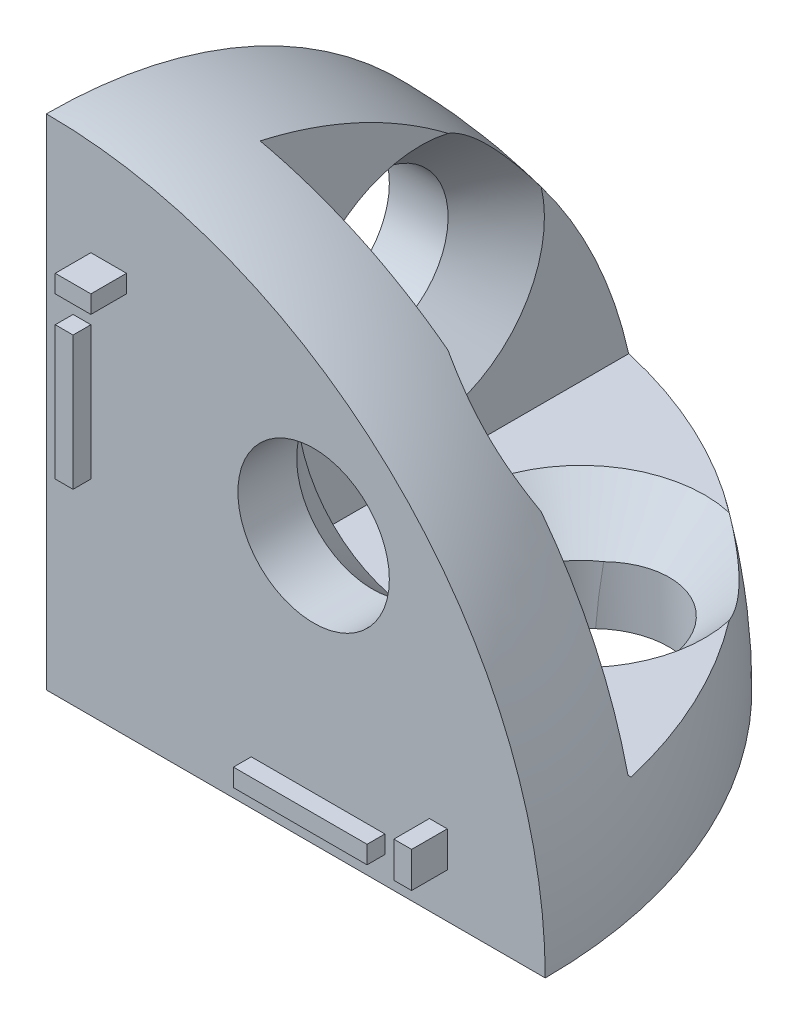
ISO-10303-21;
HEADER;
FILE_DESCRIPTION(('STEP AP214'),'2;1');
FILE_NAME('part.step','',(''),(''),'','','');
FILE_SCHEMA(('AUTOMOTIVE_DESIGN { 1 0 10303 214 1 1 1 1 }'));
ENDSEC;
DATA;
#1=APPLICATION_CONTEXT('core data for automotive mechanical design processes');
#2=APPLICATION_PROTOCOL_DEFINITION('international standard','automotive_design',2000,#1);
#3=PRODUCT_CONTEXT('',#1,'mechanical');
#4=PRODUCT('Part','Part','',(#3));
#5=PRODUCT_RELATED_PRODUCT_CATEGORY('part','',(#4));
#6=PRODUCT_DEFINITION_FORMATION('','',#4);
#7=PRODUCT_DEFINITION_CONTEXT('part definition',#1,'design');
#8=PRODUCT_DEFINITION('design','',#6,#7);
#9=PRODUCT_DEFINITION_SHAPE('','',#8);
#10=(LENGTH_UNIT() NAMED_UNIT(*) SI_UNIT(.MILLI.,.METRE.));
#11=(NAMED_UNIT(*) PLANE_ANGLE_UNIT() SI_UNIT($,.RADIAN.));
#12=(NAMED_UNIT(*) SI_UNIT($,.STERADIAN.) SOLID_ANGLE_UNIT());
#13=UNCERTAINTY_MEASURE_WITH_UNIT(LENGTH_MEASURE(1.E-05),#10,'distance_accuracy_value','');
#14=(GEOMETRIC_REPRESENTATION_CONTEXT(3) GLOBAL_UNCERTAINTY_ASSIGNED_CONTEXT((#13)) GLOBAL_UNIT_ASSIGNED_CONTEXT((#10,
#11,#12)) REPRESENTATION_CONTEXT('',''));
#15=CARTESIAN_POINT('',(0.,0.,0.));
#16=DIRECTION('',(0.,0.,1.));
#17=DIRECTION('',(1.,0.,0.));
#18=AXIS2_PLACEMENT_3D('',#15,#16,#17);
#19=CARTESIAN_POINT('',(0.,0.,0.));
#20=DIRECTION('',(0.,-1.,0.));
#21=DIRECTION('',(0.,0.,-1.));
#22=AXIS2_PLACEMENT_3D('',#19,#20,#21);
#23=SPHERICAL_SURFACE('',#22,28.);
#24=CARTESIAN_POINT('',(0.,0.,0.));
#25=DIRECTION('',(0.,0.,1.));
#26=DIRECTION('',(1.,0.,0.));
#27=AXIS2_PLACEMENT_3D('',#24,#25,#26);
#28=CIRCLE('',#27,28.);
#29=CARTESIAN_POINT('',(28.,0.,0.));
#30=VERTEX_POINT('',#29);
#31=CARTESIAN_POINT('',(0.,28.,0.));
#32=VERTEX_POINT('',#31);
#33=EDGE_CURVE('E843',#30,#32,#28,.T.);
#34=ORIENTED_EDGE('',*,*,#33,.F.);
#35=CARTESIAN_POINT('',(0.,0.,0.));
#36=DIRECTION('',(0.,-1.,0.));
#37=DIRECTION('',(0.,0.,-1.));
#38=AXIS2_PLACEMENT_3D('',#35,#36,#37);
#39=CIRCLE('',#38,28.);
#40=CARTESIAN_POINT('',(0.,0.,-28.));
#41=VERTEX_POINT('',#40);
#42=EDGE_CURVE('E854',#41,#30,#39,.T.);
#43=ORIENTED_EDGE('',*,*,#42,.F.);
#44=CARTESIAN_POINT('',(0.,0.,0.));
#45=DIRECTION('',(1.,0.,0.));
#46=DIRECTION('',(0.,0.,-1.));
#47=AXIS2_PLACEMENT_3D('',#44,#45,#46);
#48=CIRCLE('',#47,28.);
#49=EDGE_CURVE('E849',#41,#32,#48,.T.);
#50=ORIENTED_EDGE('',*,*,#49,.T.);
#51=EDGE_LOOP('',(#34,#43,#50));
#52=FACE_BOUND('',#51,.T.);
#53=CARTESIAN_POINT('',(6.,0.,0.));
#54=DIRECTION('',(-1.,0.,0.));
#55=DIRECTION('',(0.,-1.,0.));
#56=AXIS2_PLACEMENT_3D('',#53,#54,#55);
#57=CIRCLE('',#56,27.3495886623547);
#58=CARTESIAN_POINT('',(6.,21.7794223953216,-16.5425741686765));
#59=VERTEX_POINT('',#58);
#60=CARTESIAN_POINT('',(6.,26.6833281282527,-6.));
#61=VERTEX_POINT('',#60);
#62=EDGE_CURVE('E397',#59,#61,#57,.F.);
#63=ORIENTED_EDGE('',*,*,#62,.F.);
#64=CARTESIAN_POINT('',(6.00020000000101,21.7797387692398,-16.5420850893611));
#65=CARTESIAN_POINT('',(5.9018015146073,21.6241720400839,-16.7826285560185));
#66=CARTESIAN_POINT('',(5.81142255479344,21.4609988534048,-17.0218967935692));
#67=CARTESIAN_POINT('',(5.65039052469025,21.1192643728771,-17.4969100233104));
#68=CARTESIAN_POINT('',(5.57978460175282,20.94066760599,-17.7326453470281));
#69=CARTESIAN_POINT('',(5.46293774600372,20.5700760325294,-18.196680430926));
#70=CARTESIAN_POINT('',(5.41651398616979,20.3781945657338,-18.4250233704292));
#71=CARTESIAN_POINT('',(5.35041379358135,19.9812302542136,-18.8736373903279));
#72=CARTESIAN_POINT('',(5.33070928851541,19.7761615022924,-19.0939167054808));
#73=CARTESIAN_POINT('',(5.31988863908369,19.3708563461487,-19.5075895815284));
#74=CARTESIAN_POINT('',(5.32669602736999,19.1714553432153,-19.7017494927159));
#75=CARTESIAN_POINT('',(5.36384749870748,18.7648674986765,-20.0794984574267));
#76=CARTESIAN_POINT('',(5.39420077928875,18.5576776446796,-20.2630833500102));
#77=CARTESIAN_POINT('',(5.476516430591,18.1377512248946,-20.6181226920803));
#78=CARTESIAN_POINT('',(5.52845661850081,17.9250205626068,-20.7895893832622));
#79=CARTESIAN_POINT('',(5.65115930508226,17.4954367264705,-21.1199249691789));
#80=CARTESIAN_POINT('',(5.72191452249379,17.2785851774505,-21.2787987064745));
#81=CARTESIAN_POINT('',(5.83152889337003,16.974249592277,-21.4913959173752));
#82=CARTESIAN_POINT('',(5.86372662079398,16.8880208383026,-21.5504856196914));
#83=CARTESIAN_POINT('',(5.93033628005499,16.7152894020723,-21.6666130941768));
#84=CARTESIAN_POINT('',(5.96474406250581,16.6287875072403,-21.7236544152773));
#85=CARTESIAN_POINT('',(6.00020000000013,16.5420850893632,-21.7797387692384));
#86=B_SPLINE_CURVE_WITH_KNOTS('',3,(#64,#65,#66,#67,#68,#69,#70,#71,#72,#73,#74,#75,#76,#77,#78,
#79,#80,#81,#82,#83,#84,#85),.UNSPECIFIED.,.F.,.F.,(4,2,2,2,2,2,2,2,2,2,4),(0.,
0.908916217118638,1.8199815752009,2.72405510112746,3.62717803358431,4.46104346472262,
5.29523478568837,6.1285709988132,6.96158518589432,7.28969105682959,7.61719796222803),.UNSPECIFIED.);
#87=CARTESIAN_POINT('',(6.00000000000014,16.5425741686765,-21.7794223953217));
#88=VERTEX_POINT('',#87);
#89=EDGE_CURVE('E50',#59,#88,#86,.T.);
#90=ORIENTED_EDGE('',*,*,#89,.T.);
#91=CARTESIAN_POINT('',(6.,6.,-26.6833281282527));
#92=VERTEX_POINT('',#91);
#93=EDGE_CURVE('E395',#92,#88,#57,.F.);
#94=ORIENTED_EDGE('',*,*,#93,.F.);
#95=CARTESIAN_POINT('',(0.,6.,0.));
#96=DIRECTION('',(0.,-1.,0.));
#97=DIRECTION('',(0.,0.,-1.));
#98=AXIS2_PLACEMENT_3D('',#95,#96,#97);
#99=CIRCLE('',#98,27.3495886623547);
#100=CARTESIAN_POINT('',(16.5425741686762,6.00000000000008,-21.7794223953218));
#101=VERTEX_POINT('',#100);
#102=EDGE_CURVE('E403',#101,#92,#99,.F.);
#103=ORIENTED_EDGE('',*,*,#102,.F.);
#104=CARTESIAN_POINT('',(21.7797387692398,6.00020000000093,-16.5420850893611));
#105=CARTESIAN_POINT('',(21.6241720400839,5.90180151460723,-16.7826285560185));
#106=CARTESIAN_POINT('',(21.4609988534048,5.81142255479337,-17.0218967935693));
#107=CARTESIAN_POINT('',(21.1192643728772,5.65039052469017,-17.4969100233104));
#108=CARTESIAN_POINT('',(20.94066760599,5.57978460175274,-17.7326453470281));
#109=CARTESIAN_POINT('',(20.5700760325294,5.46293774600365,-18.196680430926));
#110=CARTESIAN_POINT('',(20.3781945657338,5.41651398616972,-18.4250233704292));
#111=CARTESIAN_POINT('',(19.9812302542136,5.35041379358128,-18.8736373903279));
#112=CARTESIAN_POINT('',(19.7761615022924,5.33070928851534,-19.0939167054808));
#113=CARTESIAN_POINT('',(19.3708563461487,5.31988863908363,-19.5075895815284));
#114=CARTESIAN_POINT('',(19.1714553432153,5.32669602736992,-19.7017494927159));
#115=CARTESIAN_POINT('',(18.7648674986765,5.36384749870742,-20.0794984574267));
#116=CARTESIAN_POINT('',(18.5576776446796,5.39420077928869,-20.2630833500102));
#117=CARTESIAN_POINT('',(18.1377512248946,5.47651643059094,-20.6181226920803));
#118=CARTESIAN_POINT('',(17.9250205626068,5.52845661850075,-20.7895893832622));
#119=CARTESIAN_POINT('',(17.4954367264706,5.6511593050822,-21.1199249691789));
#120=CARTESIAN_POINT('',(17.2785851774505,5.72191452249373,-21.2787987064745));
#121=CARTESIAN_POINT('',(16.974249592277,5.83152889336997,-21.4913959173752));
#122=CARTESIAN_POINT('',(16.8880208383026,5.86372662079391,-21.5504856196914));
#123=CARTESIAN_POINT('',(16.7152894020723,5.93033628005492,-21.6666130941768));
#124=CARTESIAN_POINT('',(16.6287875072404,5.96474406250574,-21.7236544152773));
#125=CARTESIAN_POINT('',(16.5420850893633,6.00020000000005,-21.7797387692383));
#126=B_SPLINE_CURVE_WITH_KNOTS('',3,(#104,#105,#106,#107,#108,#109,#110,#111,#112,#113,#114,
#115,#116,#117,#118,#119,#120,#121,#122,#123,#124,#125),.UNSPECIFIED.,.F.,.F.,(4,2,2,2,2,2,2,2,
2,2,4),(0.,0.908916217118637,1.8199815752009,2.72405510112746,3.62717803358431,4.4610434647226,
5.29523478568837,6.1285709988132,6.96158518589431,7.28969105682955,7.61719796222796),.UNSPECIFIED.);
#127=CARTESIAN_POINT('',(21.7794223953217,6.,-16.5425741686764));
#128=VERTEX_POINT('',#127);
#129=EDGE_CURVE('E879',#128,#101,#126,.T.);
#130=ORIENTED_EDGE('',*,*,#129,.F.);
#131=CARTESIAN_POINT('',(26.6437689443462,6.,-6.17329542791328));
#132=VERTEX_POINT('',#131);
#133=EDGE_CURVE('E405',#132,#128,#99,.F.);
#134=ORIENTED_EDGE('',*,*,#133,.F.);
#135=CARTESIAN_POINT('',(26.6437689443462,0.,0.));
#136=DIRECTION('',(1.,0.,0.));
#137=DIRECTION('',(0.,0.,-1.));
#138=AXIS2_PLACEMENT_3D('',#135,#136,#137);
#139=CIRCLE('',#138,8.6086919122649);
#140=CARTESIAN_POINT('',(26.6437689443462,6.17329542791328,-6.));
#141=VERTEX_POINT('',#140);
#142=EDGE_CURVE('E412',#141,#132,#139,.F.);
#143=ORIENTED_EDGE('',*,*,#142,.F.);
#144=CARTESIAN_POINT('',(0.,0.,-6.));
#145=DIRECTION('',(0.,0.,1.));
#146=DIRECTION('',(1.,0.,0.));
#147=AXIS2_PLACEMENT_3D('',#144,#145,#146);
#148=CIRCLE('',#147,27.3495886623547);
#149=CARTESIAN_POINT('',(21.7794223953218,16.5425741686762,-6.));
#150=VERTEX_POINT('',#149);
#151=EDGE_CURVE('E855',#150,#141,#148,.F.);
#152=ORIENTED_EDGE('',*,*,#151,.F.);
#153=CARTESIAN_POINT('',(21.7797387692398,16.5420850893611,-6.00020000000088));
#154=CARTESIAN_POINT('',(21.624172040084,16.7826285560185,-5.90180151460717));
#155=CARTESIAN_POINT('',(21.4609988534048,17.0218967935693,-5.81142255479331));
#156=CARTESIAN_POINT('',(21.1192643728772,17.4969100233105,-5.65039052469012));
#157=CARTESIAN_POINT('',(20.94066760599,17.7326453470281,-5.57978460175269));
#158=CARTESIAN_POINT('',(20.5700760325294,18.196680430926,-5.46293774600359));
#159=CARTESIAN_POINT('',(20.3781945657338,18.4250233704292,-5.41651398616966));
#160=CARTESIAN_POINT('',(19.9812302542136,18.8736373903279,-5.35041379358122));
#161=CARTESIAN_POINT('',(19.7761615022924,19.0939167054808,-5.33070928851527));
#162=CARTESIAN_POINT('',(19.3708563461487,19.5075895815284,-5.31988863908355));
#163=CARTESIAN_POINT('',(19.1714553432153,19.7017494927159,-5.32669602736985));
#164=CARTESIAN_POINT('',(18.7648674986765,20.0794984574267,-5.36384749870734));
#165=CARTESIAN_POINT('',(18.5576776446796,20.2630833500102,-5.39420077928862));
#166=CARTESIAN_POINT('',(18.1377512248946,20.6181226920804,-5.47651643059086));
#167=CARTESIAN_POINT('',(17.9250205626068,20.7895893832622,-5.52845661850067));
#168=CARTESIAN_POINT('',(17.4954367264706,21.1199249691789,-5.65115930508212));
#169=CARTESIAN_POINT('',(17.2785851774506,21.2787987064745,-5.72191452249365));
#170=CARTESIAN_POINT('',(16.974249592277,21.4913959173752,-5.83152889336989));
#171=CARTESIAN_POINT('',(16.8880208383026,21.5504856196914,-5.86372662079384));
#172=CARTESIAN_POINT('',(16.7152894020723,21.6666130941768,-5.93033628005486));
#173=CARTESIAN_POINT('',(16.6287875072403,21.7236544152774,-5.96474406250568));
#174=CARTESIAN_POINT('',(16.5420850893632,21.7797387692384,-6.0002));
#175=B_SPLINE_CURVE_WITH_KNOTS('',3,(#153,#154,#155,#156,#157,#158,#159,#160,#161,#162,#163,
#164,#165,#166,#167,#168,#169,#170,#171,#172,#173,#174),.UNSPECIFIED.,.F.,.F.,(4,2,2,2,2,2,2,2,
2,2,4),(0.,0.908916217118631,1.8199815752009,2.72405510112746,3.62717803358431,4.46104346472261,
5.29523478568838,6.12857099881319,6.96158518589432,7.28969105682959,7.61719796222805),.UNSPECIFIED.);
#176=CARTESIAN_POINT('',(16.5425741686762,21.7794223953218,-6.));
#177=VERTEX_POINT('',#176);
#178=EDGE_CURVE('E451',#150,#177,#175,.T.);
#179=ORIENTED_EDGE('',*,*,#178,.T.);
#180=EDGE_CURVE('E407',#61,#177,#148,.F.);
#181=ORIENTED_EDGE('',*,*,#180,.F.);
#182=EDGE_LOOP('',(#63,#90,#94,#103,#130,#134,#143,#152,#179,#181));
#183=FACE_BOUND('',#182,.T.);
#184=ADVANCED_FACE('F36',(#52,#183),#23,.T.);
#185=CARTESIAN_POINT('',(6.,27.3577373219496,-28.));
#186=DIRECTION('',(-1.,0.,0.));
#187=DIRECTION('',(0.,-1.,0.));
#188=AXIS2_PLACEMENT_3D('',#185,#186,#187);
#189=PLANE('',#188);
#190=CARTESIAN_POINT('',(6.0000000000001,15.,-15.));
#191=DIRECTION('',(-1.,0.,0.));
#192=DIRECTION('',(0.,0.,1.));
#193=AXIS2_PLACEMENT_3D('',#190,#191,#192);
#194=CIRCLE('',#193,6.95270473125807);
#195=EDGE_CURVE('E385',#88,#59,#194,.T.);
#196=ORIENTED_EDGE('',*,*,#195,.T.);
#197=ORIENTED_EDGE('',*,*,#62,.T.);
#198=DIRECTION('',(0.,-1.,0.));
#199=VECTOR('',#198,1.);
#200=CARTESIAN_POINT('',(6.,27.3577373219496,-6.));
#201=LINE('',#200,#199);
#202=CARTESIAN_POINT('',(6.,6.,-6.));
#203=VERTEX_POINT('',#202);
#204=EDGE_CURVE('E829',#61,#203,#201,.T.);
#205=ORIENTED_EDGE('',*,*,#204,.T.);
#206=DIRECTION('',(0.,0.,1.));
#207=VECTOR('',#206,1.);
#208=CARTESIAN_POINT('',(6.,6.,-28.));
#209=LINE('',#208,#207);
#210=EDGE_CURVE('E402',#92,#203,#209,.T.);
#211=ORIENTED_EDGE('',*,*,#210,.F.);
#212=ORIENTED_EDGE('',*,*,#93,.T.);
#213=EDGE_LOOP('',(#196,#197,#205,#211,#212));
#214=FACE_BOUND('',#213,.T.);
#215=ADVANCED_FACE('F400',(#214),#189,.F.);
#216=CARTESIAN_POINT('',(9.99999999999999,15.,-15.));
#217=DIRECTION('',(-1.,0.,0.));
#218=DIRECTION('',(0.,0.,1.));
#219=AXIS2_PLACEMENT_3D('',#216,#217,#218);
#220=CYLINDRICAL_SURFACE('',#219,4.25);
#221=CARTESIAN_POINT('',(0.,15.,-15.));
#222=DIRECTION('',(1.,0.,0.));
#223=DIRECTION('',(0.,0.,-1.));
#224=AXIS2_PLACEMENT_3D('',#221,#222,#223);
#225=CIRCLE('',#224,4.25);
#226=CARTESIAN_POINT('',(0.,15.,-19.25));
#227=VERTEX_POINT('',#226);
#228=EDGE_CURVE('E823',#227,#227,#225,.T.);
#229=ORIENTED_EDGE('',*,*,#228,.F.);
#230=EDGE_LOOP('',(#229));
#231=FACE_BOUND('',#230,.T.);
#232=CARTESIAN_POINT('',(3.29729526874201,15.,-15.));
#233=DIRECTION('',(-1.,0.,0.));
#234=DIRECTION('',(0.,0.,1.));
#235=AXIS2_PLACEMENT_3D('',#232,#233,#234);
#236=CIRCLE('',#235,4.25);
#237=CARTESIAN_POINT('',(3.29729526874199,15.,-10.75));
#238=VERTEX_POINT('',#237);
#239=EDGE_CURVE('E390',#238,#238,#236,.T.);
#240=ORIENTED_EDGE('',*,*,#239,.F.);
#241=EDGE_LOOP('',(#240));
#242=FACE_BOUND('',#241,.T.);
#243=ADVANCED_FACE('F902',(#231,#242),#220,.F.);
#244=CARTESIAN_POINT('',(6.,6.,-28.));
#245=DIRECTION('',(0.,-1.,0.));
#246=DIRECTION('',(0.,0.,-1.));
#247=AXIS2_PLACEMENT_3D('',#244,#245,#246);
#248=PLANE('',#247);
#249=ORIENTED_EDGE('',*,*,#133,.T.);
#250=CARTESIAN_POINT('',(15.,6.00000000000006,-15.));
#251=DIRECTION('',(0.,1.,0.));
#252=DIRECTION('',(0.,0.,1.));
#253=AXIS2_PLACEMENT_3D('',#250,#251,#252);
#254=CIRCLE('',#253,6.95270473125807);
#255=EDGE_CURVE('E57',#101,#128,#254,.T.);
#256=ORIENTED_EDGE('',*,*,#255,.F.);
#257=ORIENTED_EDGE('',*,*,#102,.T.);
#258=ORIENTED_EDGE('',*,*,#210,.T.);
#259=DIRECTION('',(1.,0.,0.));
#260=VECTOR('',#259,1.);
#261=CARTESIAN_POINT('',(6.,6.,-6.));
#262=LINE('',#261,#260);
#263=CARTESIAN_POINT('',(26.6437689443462,6.,-6.));
#264=VERTEX_POINT('',#263);
#265=EDGE_CURVE('E831',#203,#264,#262,.T.);
#266=ORIENTED_EDGE('',*,*,#265,.T.);
#267=DIRECTION('',(0.,0.,1.));
#268=VECTOR('',#267,1.);
#269=CARTESIAN_POINT('',(26.6437689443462,6.,-28.));
#270=LINE('',#269,#268);
#271=EDGE_CURVE('E837',#132,#264,#270,.T.);
#272=ORIENTED_EDGE('',*,*,#271,.F.);
#273=EDGE_LOOP('',(#249,#256,#257,#258,#266,#272));
#274=FACE_BOUND('',#273,.T.);
#275=ADVANCED_FACE('F923',(#274),#248,.F.);
#276=CARTESIAN_POINT('',(0.,0.,0.));
#277=DIRECTION('',(0.,-1.,0.));
#278=DIRECTION('',(0.,0.,-1.));
#279=AXIS2_PLACEMENT_3D('',#276,#277,#278);
#280=PLANE('',#279);
#281=ORIENTED_EDGE('',*,*,#42,.T.);
#282=DIRECTION('',(1.,0.,0.));
#283=VECTOR('',#282,1.);
#284=CARTESIAN_POINT('',(0.,0.,0.));
#285=LINE('',#284,#283);
#286=CARTESIAN_POINT('',(0.,0.,0.));
#287=VERTEX_POINT('',#286);
#288=EDGE_CURVE('E839',#287,#30,#285,.T.);
#289=ORIENTED_EDGE('',*,*,#288,.F.);
#290=DIRECTION('',(0.,0.,-1.));
#291=VECTOR('',#290,1.);
#292=CARTESIAN_POINT('',(0.,0.,0.));
#293=LINE('',#292,#291);
#294=EDGE_CURVE('E846',#287,#41,#293,.T.);
#295=ORIENTED_EDGE('',*,*,#294,.T.);
#296=EDGE_LOOP('',(#281,#289,#295));
#297=FACE_BOUND('',#296,.T.);
#298=DIRECTION('',(0.0242942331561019,0.,-0.999704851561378));
#299=VECTOR('',#298,1.);
#300=CARTESIAN_POINT('',(1.48398961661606,0.,0.0360630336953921));
#301=LINE('',#300,#299);
#302=CARTESIAN_POINT('',(1.94404895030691,0.,-18.8953247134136));
#303=VERTEX_POINT('',#302);
#304=CARTESIAN_POINT('',(1.96185859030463,0.,-19.6281893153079));
#305=VERTEX_POINT('',#304);
#306=EDGE_CURVE('E422',#303,#305,#301,.T.);
#307=ORIENTED_EDGE('',*,*,#306,.F.);
#308=DIRECTION('',(0.809540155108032,0.,0.587064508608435));
#309=VECTOR('',#308,1.);
#310=CARTESIAN_POINT('',(9.65005264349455,0.,-13.3070642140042));
#311=LINE('',#310,#309);
#312=CARTESIAN_POINT('',(2.92729238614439,0.,-18.1822935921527));
#313=VERTEX_POINT('',#312);
#314=EDGE_CURVE('E414',#303,#313,#311,.T.);
#315=ORIENTED_EDGE('',*,*,#314,.T.);
#316=DIRECTION('',(-0.0242942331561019,0.,0.999704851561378));
#317=VECTOR('',#316,1.);
#318=CARTESIAN_POINT('',(2.48397016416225,0.,0.0603639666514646));
#319=LINE('',#318,#317);
#320=CARTESIAN_POINT('',(2.96185859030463,0.,-19.6046888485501));
#321=VERTEX_POINT('',#320);
#322=EDGE_CURVE('E417',#321,#313,#319,.T.);
#323=ORIENTED_EDGE('',*,*,#322,.F.);
#324=DIRECTION('',(0.999723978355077,0.,0.0234939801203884));
#325=VECTOR('',#324,1.);
#326=CARTESIAN_POINT('',(0.462099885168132,0.,-19.6634343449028));
#327=LINE('',#326,#325);
#328=EDGE_CURVE('E420',#305,#321,#327,.T.);
#329=ORIENTED_EDGE('',*,*,#328,.F.);
#330=EDGE_LOOP('',(#307,#315,#323,#329));
#331=FACE_BOUND('',#330,.T.);
#332=DIRECTION('',(0.0242942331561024,0.,-0.999704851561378));
#333=VECTOR('',#332,1.);
#334=CARTESIAN_POINT('',(2.48397016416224,0.,0.0603639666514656));
#335=LINE('',#334,#333);
#336=CARTESIAN_POINT('',(3.02262945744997,0.,-22.1054029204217));
#337=VERTEX_POINT('',#336);
#338=CARTESIAN_POINT('',(3.04693780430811,0.,-23.1056885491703));
#339=VERTEX_POINT('',#338);
#340=EDGE_CURVE('E433',#337,#339,#335,.T.);
#341=ORIENTED_EDGE('',*,*,#340,.F.);
#342=DIRECTION('',(-0.999723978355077,0.,-0.0234939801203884));
#343=VECTOR('',#342,1.);
#344=CARTESIAN_POINT('',(0.520868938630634,0.,-22.1641954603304));
#345=LINE('',#344,#343);
#346=CARTESIAN_POINT('',(5.02262945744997,0.,-22.0584019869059));
#347=VERTEX_POINT('',#346);
#348=EDGE_CURVE('E424',#347,#337,#345,.T.);
#349=ORIENTED_EDGE('',*,*,#348,.F.);
#350=DIRECTION('',(-0.024294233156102,0.,0.999704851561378));
#351=VECTOR('',#350,1.);
#352=CARTESIAN_POINT('',(4.48393125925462,0.,0.10896583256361));
#353=LINE('',#352,#351);
#354=CARTESIAN_POINT('',(5.04693780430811,0.,-23.0586876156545));
#355=VERTEX_POINT('',#354);
#356=EDGE_CURVE('E427',#355,#347,#353,.T.);
#357=ORIENTED_EDGE('',*,*,#356,.F.);
#358=DIRECTION('',(0.999723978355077,0.,0.0234939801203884));
#359=VECTOR('',#358,1.);
#360=CARTESIAN_POINT('',(0.544376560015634,0.,-23.1644999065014));
#361=LINE('',#360,#359);
#362=EDGE_CURVE('E430',#339,#355,#361,.T.);
#363=ORIENTED_EDGE('',*,*,#362,.F.);
#364=EDGE_LOOP('',(#341,#349,#357,#363));
#365=FACE_BOUND('',#364,.T.);
#366=DIRECTION('',(0.024294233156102,0.,-0.999704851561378));
#367=VECTOR('',#366,1.);
#368=CARTESIAN_POINT('',(21.4836005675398,0.,0.522081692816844));
#369=LINE('',#368,#367);
#370=CARTESIAN_POINT('',(21.6089176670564,0.,-4.63470228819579));
#371=VERTEX_POINT('',#370);
#372=CARTESIAN_POINT('',(21.6093875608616,0.,-4.65403836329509));
#373=VERTEX_POINT('',#372);
#374=EDGE_CURVE('E444',#371,#373,#369,.T.);
#375=ORIENTED_EDGE('',*,*,#374,.F.);
#376=DIRECTION('',(0.809540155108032,0.,0.587064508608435));
#377=VECTOR('',#376,1.);
#378=CARTESIAN_POINT('',(9.65005264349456,0.,-13.3070642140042));
#379=LINE('',#378,#377);
#380=CARTESIAN_POINT('',(22.5921611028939,0.,-3.9216711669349));
#381=VERTEX_POINT('',#380);
#382=EDGE_CURVE('E436',#371,#381,#379,.T.);
#383=ORIENTED_EDGE('',*,*,#382,.T.);
#384=DIRECTION('',(-0.024294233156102,0.,0.999704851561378));
#385=VECTOR('',#384,1.);
#386=CARTESIAN_POINT('',(22.483581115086,0.,0.546382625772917));
#387=LINE('',#386,#385);
#388=CARTESIAN_POINT('',(22.6093875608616,0.,-4.63053789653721));
#389=VERTEX_POINT('',#388);
#390=EDGE_CURVE('E439',#389,#381,#387,.T.);
#391=ORIENTED_EDGE('',*,*,#390,.F.);
#392=DIRECTION('',(0.999723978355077,0.,0.0234939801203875));
#393=VECTOR('',#392,1.);
#394=CARTESIAN_POINT('',(0.121239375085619,0.,-5.15901987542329));
#395=LINE('',#394,#393);
#396=EDGE_CURVE('E442',#373,#389,#395,.T.);
#397=ORIENTED_EDGE('',*,*,#396,.F.);
#398=EDGE_LOOP('',(#375,#383,#391,#397));
#399=FACE_BOUND('',#398,.T.);
#400=CARTESIAN_POINT('',(15.3646252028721,0.,-15.309790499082));
#401=DIRECTION('',(0.,-1.,0.));
#402=DIRECTION('',(-0.587064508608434,0.,0.809540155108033));
#403=AXIS2_PLACEMENT_3D('',#400,#401,#402);
#404=ELLIPSE('',#403,4.25364176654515,4.25);
#405=CARTESIAN_POINT('',(12.4340465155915,0.,-18.3879762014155));
#406=VERTEX_POINT('',#405);
#407=CARTESIAN_POINT('',(17.927732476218,0.,-11.9192723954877));
#408=VERTEX_POINT('',#407);
#409=EDGE_CURVE('E447',#406,#408,#404,.T.);
#410=ORIENTED_EDGE('',*,*,#409,.F.);
#411=CARTESIAN_POINT('',(15.,0.,-15.));
#412=DIRECTION('',(0.,1.,0.));
#413=DIRECTION('',(1.,0.,0.));
#414=AXIS2_PLACEMENT_3D('',#411,#412,#413);
#415=CIRCLE('',#414,4.25);
#416=EDGE_CURVE('E869',#406,#408,#415,.T.);
#417=ORIENTED_EDGE('',*,*,#416,.T.);
#418=EDGE_LOOP('',(#410,#417));
#419=FACE_BOUND('',#418,.T.);
#420=ADVANCED_FACE('F910',(#297,#331,#365,#399,#419),#280,.T.);
#421=CARTESIAN_POINT('',(15.1167498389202,10.1971296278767,-14.9679795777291));
#422=DIRECTION('',(0.0242875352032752,-0.999143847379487,-0.0334916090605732));
#423=DIRECTION('',(0.,0.0335014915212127,-0.999438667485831));
#424=AXIS2_PLACEMENT_3D('',#421,#422,#423);
#425=CYLINDRICAL_SURFACE('',#424,4.25);
#426=CARTESIAN_POINT('',(11.4450369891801,3.13563417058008,-17.0190970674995));
#427=CARTESIAN_POINT('',(11.4881232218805,3.14327522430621,-17.1104422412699));
#428=CARTESIAN_POINT('',(11.5344862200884,3.15103128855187,-17.200230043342));
#429=CARTESIAN_POINT('',(11.6335131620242,3.16672984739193,-17.3762644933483));
#430=CARTESIAN_POINT('',(11.6861781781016,3.17467237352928,-17.4625105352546));
#431=CARTESIAN_POINT('',(11.7973896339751,3.19067574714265,-17.6307735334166));
#432=CARTESIAN_POINT('',(11.8559196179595,3.1987362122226,-17.7128013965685));
#433=CARTESIAN_POINT('',(11.9786606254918,3.21495013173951,-17.8724429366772));
#434=CARTESIAN_POINT('',(12.0428704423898,3.22310356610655,-17.9500575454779));
#435=CARTESIAN_POINT('',(12.1990573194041,3.2422003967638,-18.1256783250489));
#436=CARTESIAN_POINT('',(12.2931398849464,3.25316506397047,-18.2218249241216));
#437=CARTESIAN_POINT('',(12.4900338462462,3.27508891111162,-18.4047430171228));
#438=CARTESIAN_POINT('',(12.5928485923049,3.28604808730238,-18.4915108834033));
#439=CARTESIAN_POINT('',(12.8660998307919,3.31397702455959,-18.700626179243));
#440=CARTESIAN_POINT('',(13.0421874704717,3.33087929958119,-18.8157210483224));
#441=CARTESIAN_POINT('',(13.4096402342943,3.36410417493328,-19.0186412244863));
#442=CARTESIAN_POINT('',(13.6010219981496,3.38042611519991,-19.1064363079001));
#443=CARTESIAN_POINT('',(14.0216482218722,3.41433360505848,-19.2626760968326));
#444=CARTESIAN_POINT('',(14.2525014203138,3.43178893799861,-19.3268628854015));
#445=CARTESIAN_POINT('',(14.7218214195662,3.46512422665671,-19.415497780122));
#446=CARTESIAN_POINT('',(14.9602892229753,3.48100397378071,-19.4399406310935));
#447=CARTESIAN_POINT('',(15.4380097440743,3.51083409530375,-19.4483871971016));
#448=CARTESIAN_POINT('',(15.6772622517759,3.52478494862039,-19.4324009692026));
#449=CARTESIAN_POINT('',(16.1497900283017,3.55046465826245,-19.3604436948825));
#450=CARTESIAN_POINT('',(16.3830654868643,3.56219358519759,-19.3044739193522));
#451=CARTESIAN_POINT('',(16.8369093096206,3.58318457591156,-19.1541618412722));
#452=CARTESIAN_POINT('',(17.0574833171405,3.59244774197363,-19.0598367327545));
#453=CARTESIAN_POINT('',(17.4797609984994,3.6083275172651,-18.8354792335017));
#454=CARTESIAN_POINT('',(17.6814646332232,3.61494412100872,-18.7054467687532));
#455=CARTESIAN_POINT('',(18.0601465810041,3.62539456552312,-18.413444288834));
#456=CARTESIAN_POINT('',(18.2371391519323,3.62923001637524,-18.251492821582));
#457=CARTESIAN_POINT('',(18.5614990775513,3.63404446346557,-17.9001966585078));
#458=CARTESIAN_POINT('',(18.7088665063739,3.63502346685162,-17.7108520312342));
#459=CARTESIAN_POINT('',(18.9697039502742,3.63409840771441,-17.3102614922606));
#460=CARTESIAN_POINT('',(19.0831933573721,3.63219599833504,-17.0990282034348));
#461=CARTESIAN_POINT('',(19.2731592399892,3.62553784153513,-16.6605683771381));
#462=CARTESIAN_POINT('',(19.3496357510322,3.62078209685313,-16.4333418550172));
#463=CARTESIAN_POINT('',(19.4633767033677,3.60850125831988,-15.9694532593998));
#464=CARTESIAN_POINT('',(19.5006578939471,3.60097734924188,-15.7327952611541));
#465=CARTESIAN_POINT('',(19.5350099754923,3.58329754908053,-15.2566833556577));
#466=CARTESIAN_POINT('',(19.5320821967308,3.57314174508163,-15.0172295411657));
#467=CARTESIAN_POINT('',(19.486118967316,3.55039641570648,-14.5423809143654));
#468=CARTESIAN_POINT('',(19.4430932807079,3.53780748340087,-14.3069851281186));
#469=CARTESIAN_POINT('',(19.31816627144,3.51044637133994,-13.8468247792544));
#470=CARTESIAN_POINT('',(19.2362573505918,3.49567376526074,-13.6220623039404));
#471=CARTESIAN_POINT('',(19.0358603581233,3.46425654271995,-13.1894713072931));
#472=CARTESIAN_POINT('',(18.9173489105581,3.4476107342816,-12.9816537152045));
#473=CARTESIAN_POINT('',(18.647199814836,3.41284371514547,-12.5891281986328));
#474=CARTESIAN_POINT('',(18.4955931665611,3.39472389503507,-12.4043989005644));
#475=CARTESIAN_POINT('',(18.2155895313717,3.36328435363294,-12.1165259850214));
#476=CARTESIAN_POINT('',(18.0947251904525,3.35023232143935,-12.0059175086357));
#477=CARTESIAN_POINT('',(17.8410595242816,3.32380109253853,-11.7994638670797));
#478=CARTESIAN_POINT('',(17.7082616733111,3.31042199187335,-11.7036144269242));
#479=CARTESIAN_POINT('',(17.3934733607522,3.27969961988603,-11.5031207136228));
#480=CARTESIAN_POINT('',(17.2081758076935,3.26230305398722,-11.4036267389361));
#481=CARTESIAN_POINT('',(16.8247453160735,3.22762642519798,-11.2331359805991));
#482=CARTESIAN_POINT('',(16.6266008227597,3.21034648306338,-11.1621652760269));
#483=CARTESIAN_POINT('',(16.194253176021,3.17400077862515,-11.0427299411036));
#484=CARTESIAN_POINT('',(15.9588190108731,3.15501307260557,-10.9986576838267));
#485=CARTESIAN_POINT('',(15.483645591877,3.11835515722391,-10.9507708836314));
#486=CARTESIAN_POINT('',(15.2439054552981,3.10068522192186,-10.9469646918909));
#487=CARTESIAN_POINT('',(14.8864540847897,3.07565634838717,-10.9714674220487));
#488=CARTESIAN_POINT('',(14.7675800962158,3.06755418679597,-10.9846904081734));
#489=CARTESIAN_POINT('',(14.5313454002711,3.05191379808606,-11.0211146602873));
#490=CARTESIAN_POINT('',(14.4139841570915,3.04437536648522,-11.0443122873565));
#491=CARTESIAN_POINT('',(14.1815797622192,3.02993268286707,-11.1005332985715));
#492=CARTESIAN_POINT('',(14.0665371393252,3.02302857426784,-11.1335588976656));
#493=CARTESIAN_POINT('',(13.839647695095,3.00992575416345,-11.2091858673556));
#494=CARTESIAN_POINT('',(13.7277997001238,3.00372678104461,-11.2517836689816));
#495=CARTESIAN_POINT('',(13.508108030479,2.99209638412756,-11.3462388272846));
#496=CARTESIAN_POINT('',(13.4002624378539,2.98666458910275,-11.3980916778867));
#497=CARTESIAN_POINT('',(13.1893254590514,2.97662208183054,-11.5106835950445));
#498=CARTESIAN_POINT('',(13.0862323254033,2.97201106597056,-11.571419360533));
#499=CARTESIAN_POINT('',(12.8854049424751,2.96365147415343,-11.7014189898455));
#500=CARTESIAN_POINT('',(12.7876754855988,2.95990366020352,-11.7706903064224));
#501=CARTESIAN_POINT('',(12.5984080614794,2.95331577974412,-11.9171996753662));
#502=CARTESIAN_POINT('',(12.5068678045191,2.95047537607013,-11.9944347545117));
#503=CARTESIAN_POINT('',(12.3306224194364,2.94573043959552,-12.1563179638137));
#504=CARTESIAN_POINT('',(12.2459151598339,2.94382561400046,-12.2409637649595));
#505=CARTESIAN_POINT('',(12.0839411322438,2.94097020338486,-12.4170545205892));
#506=CARTESIAN_POINT('',(12.0066715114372,2.94001925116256,-12.5084968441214));
#507=CARTESIAN_POINT('',(11.8602196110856,2.93907956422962,-12.6973875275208));
#508=CARTESIAN_POINT('',(11.7910236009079,2.93908917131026,-12.7948252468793));
#509=CARTESIAN_POINT('',(11.6610870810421,2.94006454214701,-12.9951190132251));
#510=CARTESIAN_POINT('',(11.6003412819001,2.94102970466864,-13.0979716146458));
#511=CARTESIAN_POINT('',(11.5282227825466,2.94286868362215,-13.2326913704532));
#512=CARTESIAN_POINT('',(11.5127579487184,2.94330909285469,-13.2624183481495));
#513=CARTESIAN_POINT('',(11.4825487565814,2.94426327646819,-13.3221991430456));
#514=CARTESIAN_POINT('',(11.4678037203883,2.94477697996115,-13.3522526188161));
#515=CARTESIAN_POINT('',(11.4534134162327,2.94532731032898,-13.3824780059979));
#516=B_SPLINE_CURVE_WITH_KNOTS('',3,(#426,#427,#428,#429,#430,#431,#432,#433,#434,#435,#436,
#437,#438,#439,#440,#441,#442,#443,#444,#445,#446,#447,#448,#449,#450,#451,#452,#453,#454,#455,
#456,#457,#458,#459,#460,#461,#462,#463,#464,#465,#466,#467,#468,#469,#470,#471,#472,#473,#474,
#475,#476,#477,#478,#479,#480,#481,#482,#483,#484,#485,#486,#487,#488,#489,#490,#491,#492,#493,
#494,#495,#496,#497,#498,#499,#500,#501,#502,#503,#504,#505,#506,#507,#508,#509,#510,#511,#512,
#513,#514,#515),.UNSPECIFIED.,.F.,.F.,(4,2,2,2,2,2,2,2,2,2,2,2,2,2,2,2,2,2,2,2,2,2,2,2,2,2,2,2,
2,2,2,2,2,2,2,2,2,2,2,2,2,2,2,2,4),(0.,0.303788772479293,0.607629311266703,0.91064001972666,
1.21358650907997,1.61783238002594,2.02223405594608,2.65288197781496,3.28422562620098,
4.00146716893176,4.71880354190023,5.43596148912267,6.15309664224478,6.86991066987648,
7.58672618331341,8.30312638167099,9.01952478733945,9.73551233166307,10.4514991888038,
11.167179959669,11.8828370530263,12.5983199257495,13.3139426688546,14.0300233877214,
14.7454362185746,15.2374793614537,15.7293797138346,16.3600840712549,16.991363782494,
17.7087822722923,18.426349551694,18.7856419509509,19.1448033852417,19.5040458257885,
19.8631545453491,20.2220888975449,20.5808901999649,20.9400070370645,21.2989902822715,
21.6578611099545,22.0165937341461,22.3747070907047,22.7325952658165,22.8331249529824,
22.9335580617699),.UNSPECIFIED.);
#517=CARTESIAN_POINT('',(12.702890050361,3.29729526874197,-18.5757217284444));
#518=VERTEX_POINT('',#517);
#519=CARTESIAN_POINT('',(17.5737614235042,3.29729526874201,-11.6179514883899));
#520=VERTEX_POINT('',#519);
#521=EDGE_CURVE('E872',#518,#520,#516,.T.);
#522=ORIENTED_EDGE('',*,*,#521,.F.);
#523=CARTESIAN_POINT('',(13.2958218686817,6.29442443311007,-18.8933631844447));
#524=CARTESIAN_POINT('',(13.2563676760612,6.16791880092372,-18.8760760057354));
#525=CARTESIAN_POINT('',(13.2193334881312,6.04063009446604,-18.8591683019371));
#526=CARTESIAN_POINT('',(13.149571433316,5.78480670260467,-18.8262170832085));
#527=CARTESIAN_POINT('',(13.1168422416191,5.65627241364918,-18.8101733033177));
#528=CARTESIAN_POINT('',(13.0551740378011,5.39837199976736,-18.7790651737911));
#529=CARTESIAN_POINT('',(13.0262300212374,5.26900721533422,-18.7639995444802));
#530=CARTESIAN_POINT('',(12.9716062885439,5.00947371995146,-18.7348460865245));
#531=CARTESIAN_POINT('',(12.9459268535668,4.87930494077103,-18.7207583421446));
#532=CARTESIAN_POINT('',(12.8733212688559,4.4888423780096,-18.6800594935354));
#533=CARTESIAN_POINT('',(12.8306011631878,4.22761326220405,-18.654894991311));
#534=CARTESIAN_POINT('',(12.7536821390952,3.70352441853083,-18.6081240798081));
#535=CARTESIAN_POINT('',(12.7194865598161,3.44066409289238,-18.5865190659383));
#536=CARTESIAN_POINT('',(12.6576826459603,2.91424924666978,-18.5464631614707));
#537=CARTESIAN_POINT('',(12.630066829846,2.65069586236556,-18.5280086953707));
#538=CARTESIAN_POINT('',(12.5799144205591,2.12297455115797,-18.4937945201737));
#539=CARTESIAN_POINT('',(12.5573772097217,1.85880670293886,-18.4780344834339));
#540=CARTESIAN_POINT('',(12.5162053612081,1.32902837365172,-18.4487549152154));
#541=CARTESIAN_POINT('',(12.497586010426,1.06341624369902,-18.4352442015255));
#542=CARTESIAN_POINT('',(12.4635834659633,0.531898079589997,-18.4102058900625));
#543=CARTESIAN_POINT('',(12.4482001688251,0.265992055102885,-18.3986782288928));
#544=CARTESIAN_POINT('',(12.4340464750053,-1.60104772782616E-09,-18.3879761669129));
#545=B_SPLINE_CURVE_WITH_KNOTS('',3,(#523,#524,#525,#526,#527,#528,#529,#530,#531,#532,#533,
#534,#535,#536,#537,#538,#539,#540,#541,#542,#543,#544),.UNSPECIFIED.,.F.,.F.,(4,2,2,2,2,2,2,2,
2,2,4),(0.,0.400857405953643,0.801591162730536,1.201789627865,1.60202253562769,2.39945591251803,
3.19720116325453,3.99403495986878,4.7907717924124,5.59056197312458,6.39032658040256),.UNSPECIFIED.);
#546=EDGE_CURVE('E44',#518,#406,#545,.T.);
#547=ORIENTED_EDGE('',*,*,#546,.T.);
#548=ORIENTED_EDGE('',*,*,#409,.T.);
#549=CARTESIAN_POINT('',(17.9277324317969,0.,-11.9192723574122));
#550=CARTESIAN_POINT('',(17.9074199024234,0.259587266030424,-11.899991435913));
#551=CARTESIAN_POINT('',(17.8859149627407,0.519033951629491,-11.879914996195));
#552=CARTESIAN_POINT('',(17.8397883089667,1.03750364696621,-11.8378623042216));
#553=CARTESIAN_POINT('',(17.8151664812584,1.29652664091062,-11.815885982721));
#554=CARTESIAN_POINT('',(17.7621705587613,1.81306070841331,-11.7698087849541));
#555=CARTESIAN_POINT('',(17.7338102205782,2.07057387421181,-11.7457158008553));
#556=CARTESIAN_POINT('',(17.6722432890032,2.58480552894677,-11.6949713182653));
#557=CARTESIAN_POINT('',(17.6390361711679,2.8415239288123,-11.6683195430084));
#558=CARTESIAN_POINT('',(17.5663828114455,3.3540379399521,-11.612036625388));
#559=CARTESIAN_POINT('',(17.5269300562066,3.60983229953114,-11.5824023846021));
#560=CARTESIAN_POINT('',(17.4399898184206,4.11958505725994,-11.5197931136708));
#561=CARTESIAN_POINT('',(17.392505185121,4.37354407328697,-11.4868192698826));
#562=CARTESIAN_POINT('',(17.3132918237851,4.75290679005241,-11.4345867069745));
#563=CARTESIAN_POINT('',(17.2854999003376,4.8793211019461,-11.4166796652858));
#564=CARTESIAN_POINT('',(17.2268725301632,5.13130246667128,-11.379953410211));
#565=CARTESIAN_POINT('',(17.1960373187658,5.25686958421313,-11.3611342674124));
#566=CARTESIAN_POINT('',(17.1308523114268,5.50711965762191,-11.3225807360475));
#567=CARTESIAN_POINT('',(17.0964983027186,5.6318013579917,-11.3028452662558));
#568=CARTESIAN_POINT('',(17.0238010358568,5.87989951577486,-11.262564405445));
#569=CARTESIAN_POINT('',(16.9854566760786,6.00331561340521,-11.2420187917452));
#570=CARTESIAN_POINT('',(16.9448735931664,6.12595075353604,-11.2211156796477));
#571=B_SPLINE_CURVE_WITH_KNOTS('',3,(#549,#550,#551,#552,#553,#554,#555,#556,#557,#558,#559,
#560,#561,#562,#563,#564,#565,#566,#567,#568,#569,#570),.UNSPECIFIED.,.F.,.F.,(4,2,2,2,2,2,2,2,
2,2,4),(0.,0.78329469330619,1.56661794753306,2.34713532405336,3.1277372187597,3.90915860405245,
4.69030336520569,5.08226802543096,5.47420239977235,5.8666116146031,6.25912945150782),.UNSPECIFIED.);
#572=EDGE_CURVE('E446',#408,#520,#571,.T.);
#573=ORIENTED_EDGE('',*,*,#572,.T.);
#574=EDGE_LOOP('',(#522,#547,#548,#573));
#575=FACE_BOUND('',#574,.T.);
#576=ADVANCED_FACE('F461',(#575),#425,.F.);
#577=CARTESIAN_POINT('',(6.,27.3577373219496,-6.));
#578=DIRECTION('',(0.,0.,1.));
#579=DIRECTION('',(1.,0.,0.));
#580=AXIS2_PLACEMENT_3D('',#577,#578,#579);
#581=PLANE('',#580);
#582=CARTESIAN_POINT('',(15.,15.,-6.));
#583=DIRECTION('',(0.,0.,1.));
#584=DIRECTION('',(1.,0.,0.));
#585=AXIS2_PLACEMENT_3D('',#582,#583,#584);
#586=CIRCLE('',#585,6.95270473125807);
#587=EDGE_CURVE('E490',#177,#150,#586,.T.);
#588=ORIENTED_EDGE('',*,*,#587,.T.);
#589=ORIENTED_EDGE('',*,*,#151,.T.);
#590=DIRECTION('',(0.,1.,0.));
#591=VECTOR('',#590,1.);
#592=CARTESIAN_POINT('',(26.6437689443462,6.,-6.));
#593=LINE('',#592,#591);
#594=EDGE_CURVE('E834',#264,#141,#593,.T.);
#595=ORIENTED_EDGE('',*,*,#594,.F.);
#596=ORIENTED_EDGE('',*,*,#265,.F.);
#597=ORIENTED_EDGE('',*,*,#204,.F.);
#598=ORIENTED_EDGE('',*,*,#180,.T.);
#599=EDGE_LOOP('',(#588,#589,#595,#596,#597,#598));
#600=FACE_BOUND('',#599,.T.);
#601=ADVANCED_FACE('F863',(#600),#581,.F.);
#602=CARTESIAN_POINT('',(15.,15.,-10.));
#603=DIRECTION('',(0.,0.,1.));
#604=DIRECTION('',(1.,0.,0.));
#605=AXIS2_PLACEMENT_3D('',#602,#603,#604);
#606=CYLINDRICAL_SURFACE('',#605,4.25);
#607=CARTESIAN_POINT('',(15.,15.,0.));
#608=DIRECTION('',(0.,0.,1.));
#609=DIRECTION('',(1.,0.,0.));
#610=AXIS2_PLACEMENT_3D('',#607,#608,#609);
#611=CIRCLE('',#610,4.25);
#612=CARTESIAN_POINT('',(19.25,15.,0.));
#613=VERTEX_POINT('',#612);
#614=EDGE_CURVE('E826',#613,#613,#611,.T.);
#615=ORIENTED_EDGE('',*,*,#614,.T.);
#616=EDGE_LOOP('',(#615));
#617=FACE_BOUND('',#616,.T.);
#618=CARTESIAN_POINT('',(15.,15.,-3.2972952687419));
#619=DIRECTION('',(0.,0.,1.));
#620=DIRECTION('',(1.,0.,0.));
#621=AXIS2_PLACEMENT_3D('',#618,#619,#620);
#622=CIRCLE('',#621,4.25);
#623=CARTESIAN_POINT('',(19.25,15.,-3.2972952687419));
#624=VERTEX_POINT('',#623);
#625=EDGE_CURVE('E867',#624,#624,#622,.T.);
#626=ORIENTED_EDGE('',*,*,#625,.F.);
#627=EDGE_LOOP('',(#626));
#628=FACE_BOUND('',#627,.T.);
#629=ADVANCED_FACE('F931',(#617,#628),#606,.F.);
#630=CARTESIAN_POINT('',(0.,0.,0.));
#631=DIRECTION('',(0.,0.,1.));
#632=DIRECTION('',(1.,0.,0.));
#633=AXIS2_PLACEMENT_3D('',#630,#631,#632);
#634=PLANE('',#633);
#635=DIRECTION('',(1.,0.,0.));
#636=VECTOR('',#635,1.);
#637=CARTESIAN_POINT('',(2.5,21.5,0.));
#638=LINE('',#637,#636);
#639=CARTESIAN_POINT('',(2.5,21.5,0.));
#640=VERTEX_POINT('',#639);
#641=CARTESIAN_POINT('',(4.5,21.5,0.));
#642=VERTEX_POINT('',#641);
#643=EDGE_CURVE('E750',#640,#642,#638,.T.);
#644=ORIENTED_EDGE('',*,*,#643,.F.);
#645=DIRECTION('',(0.,-1.,0.));
#646=VECTOR('',#645,1.);
#647=CARTESIAN_POINT('',(2.5,22.5,0.));
#648=LINE('',#647,#646);
#649=CARTESIAN_POINT('',(2.5,22.5,0.));
#650=VERTEX_POINT('',#649);
#651=EDGE_CURVE('E736',#650,#640,#648,.T.);
#652=ORIENTED_EDGE('',*,*,#651,.F.);
#653=DIRECTION('',(-1.,0.,0.));
#654=VECTOR('',#653,1.);
#655=CARTESIAN_POINT('',(2.5,22.5,0.));
#656=LINE('',#655,#654);
#657=CARTESIAN_POINT('',(4.5,22.5,0.));
#658=VERTEX_POINT('',#657);
#659=EDGE_CURVE('E741',#658,#650,#656,.T.);
#660=ORIENTED_EDGE('',*,*,#659,.F.);
#661=DIRECTION('',(0.,1.,0.));
#662=VECTOR('',#661,1.);
#663=CARTESIAN_POINT('',(4.5,22.5,0.));
#664=LINE('',#663,#662);
#665=EDGE_CURVE('E752',#642,#658,#664,.T.);
#666=ORIENTED_EDGE('',*,*,#665,.F.);
#667=EDGE_LOOP('',(#644,#652,#660,#666));
#668=FACE_BOUND('',#667,.T.);
#669=DIRECTION('',(1.,0.,0.));
#670=VECTOR('',#669,1.);
#671=CARTESIAN_POINT('',(1.5,11.5,0.));
#672=LINE('',#671,#670);
#673=CARTESIAN_POINT('',(1.5,11.5,0.));
#674=VERTEX_POINT('',#673);
#675=CARTESIAN_POINT('',(2.5,11.5,0.));
#676=VERTEX_POINT('',#675);
#677=EDGE_CURVE('E808',#674,#676,#672,.T.);
#678=ORIENTED_EDGE('',*,*,#677,.F.);
#679=DIRECTION('',(0.,-1.,0.));
#680=VECTOR('',#679,1.);
#681=CARTESIAN_POINT('',(1.5,19.,0.));
#682=LINE('',#681,#680);
#683=CARTESIAN_POINT('',(1.5,19.,0.));
#684=VERTEX_POINT('',#683);
#685=EDGE_CURVE('E794',#684,#674,#682,.T.);
#686=ORIENTED_EDGE('',*,*,#685,.F.);
#687=DIRECTION('',(-1.,0.,0.));
#688=VECTOR('',#687,1.);
#689=CARTESIAN_POINT('',(1.5,19.,0.));
#690=LINE('',#689,#688);
#691=CARTESIAN_POINT('',(2.5,19.,0.));
#692=VERTEX_POINT('',#691);
#693=EDGE_CURVE('E799',#692,#684,#690,.T.);
#694=ORIENTED_EDGE('',*,*,#693,.F.);
#695=DIRECTION('',(0.,1.,0.));
#696=VECTOR('',#695,1.);
#697=CARTESIAN_POINT('',(2.5,19.,0.));
#698=LINE('',#697,#696);
#699=EDGE_CURVE('E810',#676,#692,#698,.T.);
#700=ORIENTED_EDGE('',*,*,#699,.F.);
#701=EDGE_LOOP('',(#678,#686,#694,#700));
#702=FACE_BOUND('',#701,.T.);
#703=ORIENTED_EDGE('',*,*,#614,.F.);
#704=EDGE_LOOP('',(#703));
#705=FACE_BOUND('',#704,.T.);
#706=ORIENTED_EDGE('',*,*,#288,.T.);
#707=ORIENTED_EDGE('',*,*,#33,.T.);
#708=DIRECTION('',(0.,-1.,0.));
#709=VECTOR('',#708,1.);
#710=CARTESIAN_POINT('',(0.,28.,0.));
#711=LINE('',#710,#709);
#712=EDGE_CURVE('E852',#32,#287,#711,.T.);
#713=ORIENTED_EDGE('',*,*,#712,.T.);
#714=EDGE_LOOP('',(#706,#707,#713));
#715=FACE_BOUND('',#714,.T.);
#716=DIRECTION('',(1.,0.,0.));
#717=VECTOR('',#716,1.);
#718=CARTESIAN_POINT('',(11.5,1.5,0.));
#719=LINE('',#718,#717);
#720=CARTESIAN_POINT('',(11.5,1.5,0.));
#721=VERTEX_POINT('',#720);
#722=CARTESIAN_POINT('',(19.,1.5,0.));
#723=VERTEX_POINT('',#722);
#724=EDGE_CURVE('E779',#721,#723,#719,.T.);
#725=ORIENTED_EDGE('',*,*,#724,.F.);
#726=DIRECTION('',(0.,-1.,0.));
#727=VECTOR('',#726,1.);
#728=CARTESIAN_POINT('',(11.5,2.5,0.));
#729=LINE('',#728,#727);
#730=CARTESIAN_POINT('',(11.5,2.5,0.));
#731=VERTEX_POINT('',#730);
#732=EDGE_CURVE('E765',#731,#721,#729,.T.);
#733=ORIENTED_EDGE('',*,*,#732,.F.);
#734=DIRECTION('',(-1.,0.,0.));
#735=VECTOR('',#734,1.);
#736=CARTESIAN_POINT('',(11.5,2.5,0.));
#737=LINE('',#736,#735);
#738=CARTESIAN_POINT('',(19.,2.5,0.));
#739=VERTEX_POINT('',#738);
#740=EDGE_CURVE('E770',#739,#731,#737,.T.);
#741=ORIENTED_EDGE('',*,*,#740,.F.);
#742=DIRECTION('',(0.,1.,0.));
#743=VECTOR('',#742,1.);
#744=CARTESIAN_POINT('',(19.,2.5,0.));
#745=LINE('',#744,#743);
#746=EDGE_CURVE('E781',#723,#739,#745,.T.);
#747=ORIENTED_EDGE('',*,*,#746,.F.);
#748=EDGE_LOOP('',(#725,#733,#741,#747));
#749=FACE_BOUND('',#748,.T.);
#750=DIRECTION('',(1.,0.,0.));
#751=VECTOR('',#750,1.);
#752=CARTESIAN_POINT('',(21.5,2.5,0.));
#753=LINE('',#752,#751);
#754=CARTESIAN_POINT('',(21.5,2.5,0.));
#755=VERTEX_POINT('',#754);
#756=CARTESIAN_POINT('',(22.5,2.5,0.));
#757=VERTEX_POINT('',#756);
#758=EDGE_CURVE('E721',#755,#757,#753,.T.);
#759=ORIENTED_EDGE('',*,*,#758,.F.);
#760=DIRECTION('',(0.,-1.,0.));
#761=VECTOR('',#760,1.);
#762=CARTESIAN_POINT('',(21.5,4.5,0.));
#763=LINE('',#762,#761);
#764=CARTESIAN_POINT('',(21.5,4.5,0.));
#765=VERTEX_POINT('',#764);
#766=EDGE_CURVE('E707',#765,#755,#763,.T.);
#767=ORIENTED_EDGE('',*,*,#766,.F.);
#768=DIRECTION('',(-1.,0.,0.));
#769=VECTOR('',#768,1.);
#770=CARTESIAN_POINT('',(21.5,4.5,0.));
#771=LINE('',#770,#769);
#772=CARTESIAN_POINT('',(22.5,4.5,0.));
#773=VERTEX_POINT('',#772);
#774=EDGE_CURVE('E712',#773,#765,#771,.T.);
#775=ORIENTED_EDGE('',*,*,#774,.F.);
#776=DIRECTION('',(0.,1.,0.));
#777=VECTOR('',#776,1.);
#778=CARTESIAN_POINT('',(22.5,4.5,0.));
#779=LINE('',#778,#777);
#780=EDGE_CURVE('E723',#757,#773,#779,.T.);
#781=ORIENTED_EDGE('',*,*,#780,.F.);
#782=EDGE_LOOP('',(#759,#767,#775,#781));
#783=FACE_BOUND('',#782,.T.);
#784=ADVANCED_FACE('F907',(#668,#702,#705,#715,#749,#783),#634,.T.);
#785=CARTESIAN_POINT('',(0.,0.,0.));
#786=DIRECTION('',(1.,0.,0.));
#787=DIRECTION('',(0.,0.,-1.));
#788=AXIS2_PLACEMENT_3D('',#785,#786,#787);
#789=PLANE('',#788);
#790=DIRECTION('',(0.,0.,1.));
#791=VECTOR('',#790,1.);
#792=CARTESIAN_POINT('',(0.,4.5,-21.5));
#793=LINE('',#792,#791);
#794=CARTESIAN_POINT('',(0.,4.5,-22.5));
#795=VERTEX_POINT('',#794);
#796=CARTESIAN_POINT('',(0.,4.5,-21.5));
#797=VERTEX_POINT('',#796);
#798=EDGE_CURVE('E592',#795,#797,#793,.T.);
#799=ORIENTED_EDGE('',*,*,#798,.T.);
#800=DIRECTION('',(0.,-1.,0.));
#801=VECTOR('',#800,1.);
#802=CARTESIAN_POINT('',(0.,4.5,-21.5));
#803=LINE('',#802,#801);
#804=CARTESIAN_POINT('',(0.,2.5,-21.5));
#805=VERTEX_POINT('',#804);
#806=EDGE_CURVE('E575',#797,#805,#803,.T.);
#807=ORIENTED_EDGE('',*,*,#806,.T.);
#808=DIRECTION('',(0.,0.,-1.));
#809=VECTOR('',#808,1.);
#810=CARTESIAN_POINT('',(0.,2.5,-21.5));
#811=LINE('',#810,#809);
#812=CARTESIAN_POINT('',(0.,2.5,-22.5));
#813=VERTEX_POINT('',#812);
#814=EDGE_CURVE('E580',#805,#813,#811,.T.);
#815=ORIENTED_EDGE('',*,*,#814,.T.);
#816=DIRECTION('',(0.,1.,0.));
#817=VECTOR('',#816,1.);
#818=CARTESIAN_POINT('',(0.,4.5,-22.5));
#819=LINE('',#818,#817);
#820=EDGE_CURVE('E595',#813,#795,#819,.T.);
#821=ORIENTED_EDGE('',*,*,#820,.T.);
#822=EDGE_LOOP('',(#799,#807,#815,#821));
#823=FACE_BOUND('',#822,.T.);
#824=DIRECTION('',(0.,0.,1.));
#825=VECTOR('',#824,1.);
#826=CARTESIAN_POINT('',(0.,22.5,-2.5));
#827=LINE('',#826,#825);
#828=CARTESIAN_POINT('',(0.,22.5,-4.5));
#829=VERTEX_POINT('',#828);
#830=CARTESIAN_POINT('',(0.,22.5,-2.5));
#831=VERTEX_POINT('',#830);
#832=EDGE_CURVE('E625',#829,#831,#827,.T.);
#833=ORIENTED_EDGE('',*,*,#832,.T.);
#834=DIRECTION('',(0.,-1.,0.));
#835=VECTOR('',#834,1.);
#836=CARTESIAN_POINT('',(0.,22.5,-2.5));
#837=LINE('',#836,#835);
#838=CARTESIAN_POINT('',(0.,21.5,-2.5));
#839=VERTEX_POINT('',#838);
#840=EDGE_CURVE('E608',#831,#839,#837,.T.);
#841=ORIENTED_EDGE('',*,*,#840,.T.);
#842=DIRECTION('',(0.,0.,-1.));
#843=VECTOR('',#842,1.);
#844=CARTESIAN_POINT('',(0.,21.5,-2.5));
#845=LINE('',#844,#843);
#846=CARTESIAN_POINT('',(0.,21.5,-4.5));
#847=VERTEX_POINT('',#846);
#848=EDGE_CURVE('E613',#839,#847,#845,.T.);
#849=ORIENTED_EDGE('',*,*,#848,.T.);
#850=DIRECTION('',(0.,1.,0.));
#851=VECTOR('',#850,1.);
#852=CARTESIAN_POINT('',(0.,22.5,-4.5));
#853=LINE('',#852,#851);
#854=EDGE_CURVE('E628',#847,#829,#853,.T.);
#855=ORIENTED_EDGE('',*,*,#854,.T.);
#856=EDGE_LOOP('',(#833,#841,#849,#855));
#857=FACE_BOUND('',#856,.T.);
#858=DIRECTION('',(0.,0.,1.));
#859=VECTOR('',#858,1.);
#860=CARTESIAN_POINT('',(0.,2.5,-11.5));
#861=LINE('',#860,#859);
#862=CARTESIAN_POINT('',(0.,2.5,-19.));
#863=VERTEX_POINT('',#862);
#864=CARTESIAN_POINT('',(0.,2.5,-11.5));
#865=VERTEX_POINT('',#864);
#866=EDGE_CURVE('E658',#863,#865,#861,.T.);
#867=ORIENTED_EDGE('',*,*,#866,.T.);
#868=DIRECTION('',(0.,-1.,0.));
#869=VECTOR('',#868,1.);
#870=CARTESIAN_POINT('',(0.,2.5,-11.5));
#871=LINE('',#870,#869);
#872=CARTESIAN_POINT('',(0.,1.5,-11.5));
#873=VERTEX_POINT('',#872);
#874=EDGE_CURVE('E641',#865,#873,#871,.T.);
#875=ORIENTED_EDGE('',*,*,#874,.T.);
#876=DIRECTION('',(0.,0.,-1.));
#877=VECTOR('',#876,1.);
#878=CARTESIAN_POINT('',(0.,1.5,-11.5));
#879=LINE('',#878,#877);
#880=CARTESIAN_POINT('',(0.,1.5,-19.));
#881=VERTEX_POINT('',#880);
#882=EDGE_CURVE('E646',#873,#881,#879,.T.);
#883=ORIENTED_EDGE('',*,*,#882,.T.);
#884=DIRECTION('',(0.,1.,0.));
#885=VECTOR('',#884,1.);
#886=CARTESIAN_POINT('',(0.,2.5,-19.));
#887=LINE('',#886,#885);
#888=EDGE_CURVE('E661',#881,#863,#887,.T.);
#889=ORIENTED_EDGE('',*,*,#888,.T.);
#890=EDGE_LOOP('',(#867,#875,#883,#889));
#891=FACE_BOUND('',#890,.T.);
#892=DIRECTION('',(0.,0.,1.));
#893=VECTOR('',#892,1.);
#894=CARTESIAN_POINT('',(0.,19.,-1.5));
#895=LINE('',#894,#893);
#896=CARTESIAN_POINT('',(0.,19.,-2.5));
#897=VERTEX_POINT('',#896);
#898=CARTESIAN_POINT('',(0.,19.,-1.5));
#899=VERTEX_POINT('',#898);
#900=EDGE_CURVE('E691',#897,#899,#895,.T.);
#901=ORIENTED_EDGE('',*,*,#900,.T.);
#902=DIRECTION('',(0.,-1.,0.));
#903=VECTOR('',#902,1.);
#904=CARTESIAN_POINT('',(0.,19.,-1.5));
#905=LINE('',#904,#903);
#906=CARTESIAN_POINT('',(0.,11.5,-1.5));
#907=VERTEX_POINT('',#906);
#908=EDGE_CURVE('E674',#899,#907,#905,.T.);
#909=ORIENTED_EDGE('',*,*,#908,.T.);
#910=DIRECTION('',(0.,0.,-1.));
#911=VECTOR('',#910,1.);
#912=CARTESIAN_POINT('',(0.,11.5,-1.5));
#913=LINE('',#912,#911);
#914=CARTESIAN_POINT('',(0.,11.5,-2.5));
#915=VERTEX_POINT('',#914);
#916=EDGE_CURVE('E679',#907,#915,#913,.T.);
#917=ORIENTED_EDGE('',*,*,#916,.T.);
#918=DIRECTION('',(0.,1.,0.));
#919=VECTOR('',#918,1.);
#920=CARTESIAN_POINT('',(0.,19.,-2.5));
#921=LINE('',#920,#919);
#922=EDGE_CURVE('E694',#915,#897,#921,.T.);
#923=ORIENTED_EDGE('',*,*,#922,.T.);
#924=EDGE_LOOP('',(#901,#909,#917,#923));
#925=FACE_BOUND('',#924,.T.);
#926=ORIENTED_EDGE('',*,*,#294,.F.);
#927=ORIENTED_EDGE('',*,*,#712,.F.);
#928=ORIENTED_EDGE('',*,*,#49,.F.);
#929=EDGE_LOOP('',(#926,#927,#928));
#930=FACE_BOUND('',#929,.T.);
#931=ORIENTED_EDGE('',*,*,#228,.T.);
#932=EDGE_LOOP('',(#931));
#933=FACE_BOUND('',#932,.T.);
#934=ADVANCED_FACE('F913',(#823,#857,#891,#925,#930,#933),#789,.F.);
#935=CARTESIAN_POINT('',(26.6437689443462,6.,-28.));
#936=DIRECTION('',(1.,0.,0.));
#937=DIRECTION('',(0.,0.,-1.));
#938=AXIS2_PLACEMENT_3D('',#935,#936,#937);
#939=PLANE('',#938);
#940=ORIENTED_EDGE('',*,*,#142,.T.);
#941=ORIENTED_EDGE('',*,*,#271,.T.);
#942=ORIENTED_EDGE('',*,*,#594,.T.);
#943=EDGE_LOOP('',(#940,#941,#942));
#944=FACE_BOUND('',#943,.T.);
#945=ADVANCED_FACE('F916',(#944),#939,.F.);
#946=CARTESIAN_POINT('',(1.5,19.,1.));
#947=DIRECTION('',(1.,0.,0.));
#948=DIRECTION('',(0.,1.,0.));
#949=AXIS2_PLACEMENT_3D('',#946,#947,#948);
#950=PLANE('',#949);
#951=ORIENTED_EDGE('',*,*,#685,.T.);
#952=DIRECTION('',(0.,0.,-1.));
#953=VECTOR('',#952,1.);
#954=CARTESIAN_POINT('',(1.5,11.5,1.));
#955=LINE('',#954,#953);
#956=CARTESIAN_POINT('',(1.5,11.5,1.));
#957=VERTEX_POINT('',#956);
#958=EDGE_CURVE('E821',#957,#674,#955,.T.);
#959=ORIENTED_EDGE('',*,*,#958,.F.);
#960=DIRECTION('',(0.,-1.,0.));
#961=VECTOR('',#960,1.);
#962=CARTESIAN_POINT('',(1.5,19.,1.));
#963=LINE('',#962,#961);
#964=CARTESIAN_POINT('',(1.5,19.,1.));
#965=VERTEX_POINT('',#964);
#966=EDGE_CURVE('E795',#965,#957,#963,.T.);
#967=ORIENTED_EDGE('',*,*,#966,.F.);
#968=DIRECTION('',(0.,0.,-1.));
#969=VECTOR('',#968,1.);
#970=CARTESIAN_POINT('',(1.5,19.,1.));
#971=LINE('',#970,#969);
#972=EDGE_CURVE('E805',#965,#684,#971,.T.);
#973=ORIENTED_EDGE('',*,*,#972,.T.);
#974=EDGE_LOOP('',(#951,#959,#967,#973));
#975=FACE_BOUND('',#974,.T.);
#976=ADVANCED_FACE('F938',(#975),#950,.F.);
#977=CARTESIAN_POINT('',(1.5,11.5,1.));
#978=DIRECTION('',(0.,1.,0.));
#979=DIRECTION('',(0.,0.,1.));
#980=AXIS2_PLACEMENT_3D('',#977,#978,#979);
#981=PLANE('',#980);
#982=ORIENTED_EDGE('',*,*,#677,.T.);
#983=DIRECTION('',(0.,0.,-1.));
#984=VECTOR('',#983,1.);
#985=CARTESIAN_POINT('',(2.5,11.5,1.));
#986=LINE('',#985,#984);
#987=CARTESIAN_POINT('',(2.5,11.5,1.));
#988=VERTEX_POINT('',#987);
#989=EDGE_CURVE('E818',#988,#676,#986,.T.);
#990=ORIENTED_EDGE('',*,*,#989,.F.);
#991=DIRECTION('',(1.,0.,0.));
#992=VECTOR('',#991,1.);
#993=CARTESIAN_POINT('',(1.5,11.5,1.));
#994=LINE('',#993,#992);
#995=EDGE_CURVE('E798',#957,#988,#994,.T.);
#996=ORIENTED_EDGE('',*,*,#995,.F.);
#997=ORIENTED_EDGE('',*,*,#958,.T.);
#998=EDGE_LOOP('',(#982,#990,#996,#997));
#999=FACE_BOUND('',#998,.T.);
#1000=ADVANCED_FACE('F1444',(#999),#981,.F.);
#1001=CARTESIAN_POINT('',(2.5,19.,1.));
#1002=DIRECTION('',(-1.,0.,0.));
#1003=DIRECTION('',(0.,-1.,0.));
#1004=AXIS2_PLACEMENT_3D('',#1001,#1002,#1003);
#1005=PLANE('',#1004);
#1006=ORIENTED_EDGE('',*,*,#699,.T.);
#1007=DIRECTION('',(0.,0.,-1.));
#1008=VECTOR('',#1007,1.);
#1009=CARTESIAN_POINT('',(2.5,19.,1.));
#1010=LINE('',#1009,#1008);
#1011=CARTESIAN_POINT('',(2.5,19.,1.));
#1012=VERTEX_POINT('',#1011);
#1013=EDGE_CURVE('E816',#1012,#692,#1010,.T.);
#1014=ORIENTED_EDGE('',*,*,#1013,.F.);
#1015=DIRECTION('',(0.,1.,0.));
#1016=VECTOR('',#1015,1.);
#1017=CARTESIAN_POINT('',(2.5,19.,1.));
#1018=LINE('',#1017,#1016);
#1019=EDGE_CURVE('E801',#988,#1012,#1018,.T.);
#1020=ORIENTED_EDGE('',*,*,#1019,.F.);
#1021=ORIENTED_EDGE('',*,*,#989,.T.);
#1022=EDGE_LOOP('',(#1006,#1014,#1020,#1021));
#1023=FACE_BOUND('',#1022,.T.);
#1024=ADVANCED_FACE('F1436',(#1023),#1005,.F.);
#1025=CARTESIAN_POINT('',(1.5,19.,1.));
#1026=DIRECTION('',(0.,-1.,0.));
#1027=DIRECTION('',(0.,0.,-1.));
#1028=AXIS2_PLACEMENT_3D('',#1025,#1026,#1027);
#1029=PLANE('',#1028);
#1030=ORIENTED_EDGE('',*,*,#693,.T.);
#1031=ORIENTED_EDGE('',*,*,#972,.F.);
#1032=DIRECTION('',(-1.,0.,0.));
#1033=VECTOR('',#1032,1.);
#1034=CARTESIAN_POINT('',(1.5,19.,1.));
#1035=LINE('',#1034,#1033);
#1036=EDGE_CURVE('E803',#1012,#965,#1035,.T.);
#1037=ORIENTED_EDGE('',*,*,#1036,.F.);
#1038=ORIENTED_EDGE('',*,*,#1013,.T.);
#1039=EDGE_LOOP('',(#1030,#1031,#1037,#1038));
#1040=FACE_BOUND('',#1039,.T.);
#1041=ADVANCED_FACE('F1428',(#1040),#1029,.F.);
#1042=CARTESIAN_POINT('',(1.5,11.5,1.));
#1043=DIRECTION('',(0.,0.,1.));
#1044=DIRECTION('',(1.,0.,0.));
#1045=AXIS2_PLACEMENT_3D('',#1042,#1043,#1044);
#1046=PLANE('',#1045);
#1047=ORIENTED_EDGE('',*,*,#966,.T.);
#1048=ORIENTED_EDGE('',*,*,#995,.T.);
#1049=ORIENTED_EDGE('',*,*,#1019,.T.);
#1050=ORIENTED_EDGE('',*,*,#1036,.T.);
#1051=EDGE_LOOP('',(#1047,#1048,#1049,#1050));
#1052=FACE_BOUND('',#1051,.T.);
#1053=ADVANCED_FACE('F1420',(#1052),#1046,.T.);
#1054=CARTESIAN_POINT('',(11.5,2.5,1.));
#1055=DIRECTION('',(1.,0.,0.));
#1056=DIRECTION('',(0.,0.,-1.));
#1057=AXIS2_PLACEMENT_3D('',#1054,#1055,#1056);
#1058=PLANE('',#1057);
#1059=ORIENTED_EDGE('',*,*,#732,.T.);
#1060=DIRECTION('',(0.,0.,-1.));
#1061=VECTOR('',#1060,1.);
#1062=CARTESIAN_POINT('',(11.5,1.5,1.));
#1063=LINE('',#1062,#1061);
#1064=CARTESIAN_POINT('',(11.5,1.5,1.));
#1065=VERTEX_POINT('',#1064);
#1066=EDGE_CURVE('E792',#1065,#721,#1063,.T.);
#1067=ORIENTED_EDGE('',*,*,#1066,.F.);
#1068=DIRECTION('',(0.,-1.,0.));
#1069=VECTOR('',#1068,1.);
#1070=CARTESIAN_POINT('',(11.5,2.5,1.));
#1071=LINE('',#1070,#1069);
#1072=CARTESIAN_POINT('',(11.5,2.5,1.));
#1073=VERTEX_POINT('',#1072);
#1074=EDGE_CURVE('E766',#1073,#1065,#1071,.T.);
#1075=ORIENTED_EDGE('',*,*,#1074,.F.);
#1076=DIRECTION('',(0.,0.,-1.));
#1077=VECTOR('',#1076,1.);
#1078=CARTESIAN_POINT('',(11.5,2.5,1.));
#1079=LINE('',#1078,#1077);
#1080=EDGE_CURVE('E776',#1073,#731,#1079,.T.);
#1081=ORIENTED_EDGE('',*,*,#1080,.T.);
#1082=EDGE_LOOP('',(#1059,#1067,#1075,#1081));
#1083=FACE_BOUND('',#1082,.T.);
#1084=ADVANCED_FACE('F1412',(#1083),#1058,.F.);
#1085=CARTESIAN_POINT('',(11.5,1.5,1.));
#1086=DIRECTION('',(0.,1.,0.));
#1087=DIRECTION('',(0.,0.,1.));
#1088=AXIS2_PLACEMENT_3D('',#1085,#1086,#1087);
#1089=PLANE('',#1088);
#1090=ORIENTED_EDGE('',*,*,#724,.T.);
#1091=DIRECTION('',(0.,0.,-1.));
#1092=VECTOR('',#1091,1.);
#1093=CARTESIAN_POINT('',(19.,1.5,1.));
#1094=LINE('',#1093,#1092);
#1095=CARTESIAN_POINT('',(19.,1.5,1.));
#1096=VERTEX_POINT('',#1095);
#1097=EDGE_CURVE('E789',#1096,#723,#1094,.T.);
#1098=ORIENTED_EDGE('',*,*,#1097,.F.);
#1099=DIRECTION('',(1.,0.,0.));
#1100=VECTOR('',#1099,1.);
#1101=CARTESIAN_POINT('',(11.5,1.5,1.));
#1102=LINE('',#1101,#1100);
#1103=EDGE_CURVE('E769',#1065,#1096,#1102,.T.);
#1104=ORIENTED_EDGE('',*,*,#1103,.F.);
#1105=ORIENTED_EDGE('',*,*,#1066,.T.);
#1106=EDGE_LOOP('',(#1090,#1098,#1104,#1105));
#1107=FACE_BOUND('',#1106,.T.);
#1108=ADVANCED_FACE('F1404',(#1107),#1089,.F.);
#1109=CARTESIAN_POINT('',(19.,2.5,1.));
#1110=DIRECTION('',(-1.,0.,0.));
#1111=DIRECTION('',(0.,0.,1.));
#1112=AXIS2_PLACEMENT_3D('',#1109,#1110,#1111);
#1113=PLANE('',#1112);
#1114=ORIENTED_EDGE('',*,*,#746,.T.);
#1115=DIRECTION('',(0.,0.,-1.));
#1116=VECTOR('',#1115,1.);
#1117=CARTESIAN_POINT('',(19.,2.5,1.));
#1118=LINE('',#1117,#1116);
#1119=CARTESIAN_POINT('',(19.,2.5,1.));
#1120=VERTEX_POINT('',#1119);
#1121=EDGE_CURVE('E787',#1120,#739,#1118,.T.);
#1122=ORIENTED_EDGE('',*,*,#1121,.F.);
#1123=DIRECTION('',(0.,1.,0.));
#1124=VECTOR('',#1123,1.);
#1125=CARTESIAN_POINT('',(19.,2.5,1.));
#1126=LINE('',#1125,#1124);
#1127=EDGE_CURVE('E772',#1096,#1120,#1126,.T.);
#1128=ORIENTED_EDGE('',*,*,#1127,.F.);
#1129=ORIENTED_EDGE('',*,*,#1097,.T.);
#1130=EDGE_LOOP('',(#1114,#1122,#1128,#1129));
#1131=FACE_BOUND('',#1130,.T.);
#1132=ADVANCED_FACE('F1396',(#1131),#1113,.F.);
#1133=CARTESIAN_POINT('',(11.5,2.5,1.));
#1134=DIRECTION('',(0.,-1.,0.));
#1135=DIRECTION('',(0.,0.,-1.));
#1136=AXIS2_PLACEMENT_3D('',#1133,#1134,#1135);
#1137=PLANE('',#1136);
#1138=ORIENTED_EDGE('',*,*,#740,.T.);
#1139=ORIENTED_EDGE('',*,*,#1080,.F.);
#1140=DIRECTION('',(-1.,0.,0.));
#1141=VECTOR('',#1140,1.);
#1142=CARTESIAN_POINT('',(11.5,2.5,1.));
#1143=LINE('',#1142,#1141);
#1144=EDGE_CURVE('E774',#1120,#1073,#1143,.T.);
#1145=ORIENTED_EDGE('',*,*,#1144,.F.);
#1146=ORIENTED_EDGE('',*,*,#1121,.T.);
#1147=EDGE_LOOP('',(#1138,#1139,#1145,#1146));
#1148=FACE_BOUND('',#1147,.T.);
#1149=ADVANCED_FACE('F1388',(#1148),#1137,.F.);
#1150=CARTESIAN_POINT('',(11.5,1.5,1.));
#1151=DIRECTION('',(0.,0.,1.));
#1152=DIRECTION('',(1.,0.,0.));
#1153=AXIS2_PLACEMENT_3D('',#1150,#1151,#1152);
#1154=PLANE('',#1153);
#1155=ORIENTED_EDGE('',*,*,#1074,.T.);
#1156=ORIENTED_EDGE('',*,*,#1103,.T.);
#1157=ORIENTED_EDGE('',*,*,#1127,.T.);
#1158=ORIENTED_EDGE('',*,*,#1144,.T.);
#1159=EDGE_LOOP('',(#1155,#1156,#1157,#1158));
#1160=FACE_BOUND('',#1159,.T.);
#1161=ADVANCED_FACE('F1379',(#1160),#1154,.T.);
#1162=CARTESIAN_POINT('',(2.5,22.5,2.));
#1163=DIRECTION('',(1.,0.,0.));
#1164=DIRECTION('',(0.,1.,0.));
#1165=AXIS2_PLACEMENT_3D('',#1162,#1163,#1164);
#1166=PLANE('',#1165);
#1167=ORIENTED_EDGE('',*,*,#651,.T.);
#1168=DIRECTION('',(0.,0.,-1.));
#1169=VECTOR('',#1168,1.);
#1170=CARTESIAN_POINT('',(2.5,21.5,2.));
#1171=LINE('',#1170,#1169);
#1172=CARTESIAN_POINT('',(2.5,21.5,2.));
#1173=VERTEX_POINT('',#1172);
#1174=EDGE_CURVE('E763',#1173,#640,#1171,.T.);
#1175=ORIENTED_EDGE('',*,*,#1174,.F.);
#1176=DIRECTION('',(0.,-1.,0.));
#1177=VECTOR('',#1176,1.);
#1178=CARTESIAN_POINT('',(2.5,22.5,2.));
#1179=LINE('',#1178,#1177);
#1180=CARTESIAN_POINT('',(2.5,22.5,2.));
#1181=VERTEX_POINT('',#1180);
#1182=EDGE_CURVE('E737',#1181,#1173,#1179,.T.);
#1183=ORIENTED_EDGE('',*,*,#1182,.F.);
#1184=DIRECTION('',(0.,0.,-1.));
#1185=VECTOR('',#1184,1.);
#1186=CARTESIAN_POINT('',(2.5,22.5,2.));
#1187=LINE('',#1186,#1185);
#1188=EDGE_CURVE('E747',#1181,#650,#1187,.T.);
#1189=ORIENTED_EDGE('',*,*,#1188,.T.);
#1190=EDGE_LOOP('',(#1167,#1175,#1183,#1189));
#1191=FACE_BOUND('',#1190,.T.);
#1192=ADVANCED_FACE('F1371',(#1191),#1166,.F.);
#1193=CARTESIAN_POINT('',(2.5,21.5,2.));
#1194=DIRECTION('',(0.,1.,0.));
#1195=DIRECTION('',(0.,0.,1.));
#1196=AXIS2_PLACEMENT_3D('',#1193,#1194,#1195);
#1197=PLANE('',#1196);
#1198=ORIENTED_EDGE('',*,*,#643,.T.);
#1199=DIRECTION('',(0.,0.,-1.));
#1200=VECTOR('',#1199,1.);
#1201=CARTESIAN_POINT('',(4.5,21.5,2.));
#1202=LINE('',#1201,#1200);
#1203=CARTESIAN_POINT('',(4.5,21.5,2.));
#1204=VERTEX_POINT('',#1203);
#1205=EDGE_CURVE('E760',#1204,#642,#1202,.T.);
#1206=ORIENTED_EDGE('',*,*,#1205,.F.);
#1207=DIRECTION('',(1.,0.,0.));
#1208=VECTOR('',#1207,1.);
#1209=CARTESIAN_POINT('',(2.5,21.5,2.));
#1210=LINE('',#1209,#1208);
#1211=EDGE_CURVE('E740',#1173,#1204,#1210,.T.);
#1212=ORIENTED_EDGE('',*,*,#1211,.F.);
#1213=ORIENTED_EDGE('',*,*,#1174,.T.);
#1214=EDGE_LOOP('',(#1198,#1206,#1212,#1213));
#1215=FACE_BOUND('',#1214,.T.);
#1216=ADVANCED_FACE('F1363',(#1215),#1197,.F.);
#1217=CARTESIAN_POINT('',(4.5,22.5,2.));
#1218=DIRECTION('',(-1.,0.,0.));
#1219=DIRECTION('',(0.,0.,1.));
#1220=AXIS2_PLACEMENT_3D('',#1217,#1218,#1219);
#1221=PLANE('',#1220);
#1222=ORIENTED_EDGE('',*,*,#665,.T.);
#1223=DIRECTION('',(0.,0.,-1.));
#1224=VECTOR('',#1223,1.);
#1225=CARTESIAN_POINT('',(4.5,22.5,2.));
#1226=LINE('',#1225,#1224);
#1227=CARTESIAN_POINT('',(4.5,22.5,2.));
#1228=VERTEX_POINT('',#1227);
#1229=EDGE_CURVE('E758',#1228,#658,#1226,.T.);
#1230=ORIENTED_EDGE('',*,*,#1229,.F.);
#1231=DIRECTION('',(0.,1.,0.));
#1232=VECTOR('',#1231,1.);
#1233=CARTESIAN_POINT('',(4.5,22.5,2.));
#1234=LINE('',#1233,#1232);
#1235=EDGE_CURVE('E743',#1204,#1228,#1234,.T.);
#1236=ORIENTED_EDGE('',*,*,#1235,.F.);
#1237=ORIENTED_EDGE('',*,*,#1205,.T.);
#1238=EDGE_LOOP('',(#1222,#1230,#1236,#1237));
#1239=FACE_BOUND('',#1238,.T.);
#1240=ADVANCED_FACE('F1355',(#1239),#1221,.F.);
#1241=CARTESIAN_POINT('',(2.5,22.5,2.));
#1242=DIRECTION('',(0.,-1.,0.));
#1243=DIRECTION('',(0.,0.,-1.));
#1244=AXIS2_PLACEMENT_3D('',#1241,#1242,#1243);
#1245=PLANE('',#1244);
#1246=ORIENTED_EDGE('',*,*,#659,.T.);
#1247=ORIENTED_EDGE('',*,*,#1188,.F.);
#1248=DIRECTION('',(-1.,0.,0.));
#1249=VECTOR('',#1248,1.);
#1250=CARTESIAN_POINT('',(2.5,22.5,2.));
#1251=LINE('',#1250,#1249);
#1252=EDGE_CURVE('E745',#1228,#1181,#1251,.T.);
#1253=ORIENTED_EDGE('',*,*,#1252,.F.);
#1254=ORIENTED_EDGE('',*,*,#1229,.T.);
#1255=EDGE_LOOP('',(#1246,#1247,#1253,#1254));
#1256=FACE_BOUND('',#1255,.T.);
#1257=ADVANCED_FACE('F1347',(#1256),#1245,.F.);
#1258=CARTESIAN_POINT('',(2.5,21.5,2.));
#1259=DIRECTION('',(0.,0.,1.));
#1260=DIRECTION('',(1.,0.,0.));
#1261=AXIS2_PLACEMENT_3D('',#1258,#1259,#1260);
#1262=PLANE('',#1261);
#1263=ORIENTED_EDGE('',*,*,#1182,.T.);
#1264=ORIENTED_EDGE('',*,*,#1211,.T.);
#1265=ORIENTED_EDGE('',*,*,#1235,.T.);
#1266=ORIENTED_EDGE('',*,*,#1252,.T.);
#1267=EDGE_LOOP('',(#1263,#1264,#1265,#1266));
#1268=FACE_BOUND('',#1267,.T.);
#1269=ADVANCED_FACE('F1339',(#1268),#1262,.T.);
#1270=CARTESIAN_POINT('',(21.5,4.5,2.));
#1271=DIRECTION('',(1.,0.,0.));
#1272=DIRECTION('',(0.,0.,-1.));
#1273=AXIS2_PLACEMENT_3D('',#1270,#1271,#1272);
#1274=PLANE('',#1273);
#1275=ORIENTED_EDGE('',*,*,#766,.T.);
#1276=DIRECTION('',(0.,0.,-1.));
#1277=VECTOR('',#1276,1.);
#1278=CARTESIAN_POINT('',(21.5,2.5,2.));
#1279=LINE('',#1278,#1277);
#1280=CARTESIAN_POINT('',(21.5,2.5,2.));
#1281=VERTEX_POINT('',#1280);
#1282=EDGE_CURVE('E734',#1281,#755,#1279,.T.);
#1283=ORIENTED_EDGE('',*,*,#1282,.F.);
#1284=DIRECTION('',(0.,-1.,0.));
#1285=VECTOR('',#1284,1.);
#1286=CARTESIAN_POINT('',(21.5,4.5,2.));
#1287=LINE('',#1286,#1285);
#1288=CARTESIAN_POINT('',(21.5,4.5,2.));
#1289=VERTEX_POINT('',#1288);
#1290=EDGE_CURVE('E708',#1289,#1281,#1287,.T.);
#1291=ORIENTED_EDGE('',*,*,#1290,.F.);
#1292=DIRECTION('',(0.,0.,-1.));
#1293=VECTOR('',#1292,1.);
#1294=CARTESIAN_POINT('',(21.5,4.5,2.));
#1295=LINE('',#1294,#1293);
#1296=EDGE_CURVE('E718',#1289,#765,#1295,.T.);
#1297=ORIENTED_EDGE('',*,*,#1296,.T.);
#1298=EDGE_LOOP('',(#1275,#1283,#1291,#1297));
#1299=FACE_BOUND('',#1298,.T.);
#1300=ADVANCED_FACE('F1331',(#1299),#1274,.F.);
#1301=CARTESIAN_POINT('',(21.5,2.5,2.));
#1302=DIRECTION('',(0.,1.,0.));
#1303=DIRECTION('',(0.,0.,1.));
#1304=AXIS2_PLACEMENT_3D('',#1301,#1302,#1303);
#1305=PLANE('',#1304);
#1306=ORIENTED_EDGE('',*,*,#758,.T.);
#1307=DIRECTION('',(0.,0.,-1.));
#1308=VECTOR('',#1307,1.);
#1309=CARTESIAN_POINT('',(22.5,2.5,2.));
#1310=LINE('',#1309,#1308);
#1311=CARTESIAN_POINT('',(22.5,2.5,2.));
#1312=VERTEX_POINT('',#1311);
#1313=EDGE_CURVE('E731',#1312,#757,#1310,.T.);
#1314=ORIENTED_EDGE('',*,*,#1313,.F.);
#1315=DIRECTION('',(1.,0.,0.));
#1316=VECTOR('',#1315,1.);
#1317=CARTESIAN_POINT('',(21.5,2.5,2.));
#1318=LINE('',#1317,#1316);
#1319=EDGE_CURVE('E711',#1281,#1312,#1318,.T.);
#1320=ORIENTED_EDGE('',*,*,#1319,.F.);
#1321=ORIENTED_EDGE('',*,*,#1282,.T.);
#1322=EDGE_LOOP('',(#1306,#1314,#1320,#1321));
#1323=FACE_BOUND('',#1322,.T.);
#1324=ADVANCED_FACE('F1323',(#1323),#1305,.F.);
#1325=CARTESIAN_POINT('',(22.5,4.5,2.));
#1326=DIRECTION('',(-1.,0.,0.));
#1327=DIRECTION('',(0.,0.,1.));
#1328=AXIS2_PLACEMENT_3D('',#1325,#1326,#1327);
#1329=PLANE('',#1328);
#1330=ORIENTED_EDGE('',*,*,#780,.T.);
#1331=DIRECTION('',(0.,0.,-1.));
#1332=VECTOR('',#1331,1.);
#1333=CARTESIAN_POINT('',(22.5,4.5,2.));
#1334=LINE('',#1333,#1332);
#1335=CARTESIAN_POINT('',(22.5,4.5,2.));
#1336=VERTEX_POINT('',#1335);
#1337=EDGE_CURVE('E729',#1336,#773,#1334,.T.);
#1338=ORIENTED_EDGE('',*,*,#1337,.F.);
#1339=DIRECTION('',(0.,1.,0.));
#1340=VECTOR('',#1339,1.);
#1341=CARTESIAN_POINT('',(22.5,4.5,2.));
#1342=LINE('',#1341,#1340);
#1343=EDGE_CURVE('E714',#1312,#1336,#1342,.T.);
#1344=ORIENTED_EDGE('',*,*,#1343,.F.);
#1345=ORIENTED_EDGE('',*,*,#1313,.T.);
#1346=EDGE_LOOP('',(#1330,#1338,#1344,#1345));
#1347=FACE_BOUND('',#1346,.T.);
#1348=ADVANCED_FACE('F1315',(#1347),#1329,.F.);
#1349=CARTESIAN_POINT('',(21.5,4.5,2.));
#1350=DIRECTION('',(0.,-1.,0.));
#1351=DIRECTION('',(1.,0.,0.));
#1352=AXIS2_PLACEMENT_3D('',#1349,#1350,#1351);
#1353=PLANE('',#1352);
#1354=ORIENTED_EDGE('',*,*,#774,.T.);
#1355=ORIENTED_EDGE('',*,*,#1296,.F.);
#1356=DIRECTION('',(-1.,0.,0.));
#1357=VECTOR('',#1356,1.);
#1358=CARTESIAN_POINT('',(21.5,4.5,2.));
#1359=LINE('',#1358,#1357);
#1360=EDGE_CURVE('E716',#1336,#1289,#1359,.T.);
#1361=ORIENTED_EDGE('',*,*,#1360,.F.);
#1362=ORIENTED_EDGE('',*,*,#1337,.T.);
#1363=EDGE_LOOP('',(#1354,#1355,#1361,#1362));
#1364=FACE_BOUND('',#1363,.T.);
#1365=ADVANCED_FACE('F1307',(#1364),#1353,.F.);
#1366=CARTESIAN_POINT('',(21.5,2.5,2.));
#1367=DIRECTION('',(0.,0.,1.));
#1368=DIRECTION('',(1.,0.,0.));
#1369=AXIS2_PLACEMENT_3D('',#1366,#1367,#1368);
#1370=PLANE('',#1369);
#1371=ORIENTED_EDGE('',*,*,#1290,.T.);
#1372=ORIENTED_EDGE('',*,*,#1319,.T.);
#1373=ORIENTED_EDGE('',*,*,#1343,.T.);
#1374=ORIENTED_EDGE('',*,*,#1360,.T.);
#1375=EDGE_LOOP('',(#1371,#1372,#1373,#1374));
#1376=FACE_BOUND('',#1375,.T.);
#1377=ADVANCED_FACE('F1298',(#1376),#1370,.T.);
#1378=CARTESIAN_POINT('',(-0.999999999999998,19.,-1.5));
#1379=DIRECTION('',(0.,0.,1.));
#1380=DIRECTION('',(0.,-1.,0.));
#1381=AXIS2_PLACEMENT_3D('',#1378,#1379,#1380);
#1382=PLANE('',#1381);
#1383=ORIENTED_EDGE('',*,*,#908,.F.);
#1384=DIRECTION('',(1.,0.,0.));
#1385=VECTOR('',#1384,1.);
#1386=CARTESIAN_POINT('',(-0.999999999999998,19.,-1.5));
#1387=LINE('',#1386,#1385);
#1388=CARTESIAN_POINT('',(-0.999999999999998,19.,-1.5));
#1389=VERTEX_POINT('',#1388);
#1390=EDGE_CURVE('E705',#1389,#899,#1387,.T.);
#1391=ORIENTED_EDGE('',*,*,#1390,.F.);
#1392=DIRECTION('',(0.,-1.,0.));
#1393=VECTOR('',#1392,1.);
#1394=CARTESIAN_POINT('',(-0.999999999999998,19.,-1.5));
#1395=LINE('',#1394,#1393);
#1396=CARTESIAN_POINT('',(-0.999999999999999,11.5,-1.5));
#1397=VERTEX_POINT('',#1396);
#1398=EDGE_CURVE('E675',#1389,#1397,#1395,.T.);
#1399=ORIENTED_EDGE('',*,*,#1398,.T.);
#1400=DIRECTION('',(1.,0.,0.));
#1401=VECTOR('',#1400,1.);
#1402=CARTESIAN_POINT('',(-0.999999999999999,11.5,-1.5));
#1403=LINE('',#1402,#1401);
#1404=EDGE_CURVE('E688',#1397,#907,#1403,.T.);
#1405=ORIENTED_EDGE('',*,*,#1404,.T.);
#1406=EDGE_LOOP('',(#1383,#1391,#1399,#1405));
#1407=FACE_BOUND('',#1406,.T.);
#1408=ADVANCED_FACE('F1290',(#1407),#1382,.T.);
#1409=CARTESIAN_POINT('',(-0.999999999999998,19.,-1.5));
#1410=DIRECTION('',(0.,1.,0.));
#1411=DIRECTION('',(-1.,0.,0.));
#1412=AXIS2_PLACEMENT_3D('',#1409,#1410,#1411);
#1413=PLANE('',#1412);
#1414=ORIENTED_EDGE('',*,*,#900,.F.);
#1415=DIRECTION('',(1.,0.,0.));
#1416=VECTOR('',#1415,1.);
#1417=CARTESIAN_POINT('',(-0.999999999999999,19.,-2.5));
#1418=LINE('',#1417,#1416);
#1419=CARTESIAN_POINT('',(-0.999999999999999,19.,-2.5));
#1420=VERTEX_POINT('',#1419);
#1421=EDGE_CURVE('E703',#1420,#897,#1418,.T.);
#1422=ORIENTED_EDGE('',*,*,#1421,.F.);
#1423=DIRECTION('',(0.,0.,1.));
#1424=VECTOR('',#1423,1.);
#1425=CARTESIAN_POINT('',(-0.999999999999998,19.,-1.5));
#1426=LINE('',#1425,#1424);
#1427=EDGE_CURVE('E678',#1420,#1389,#1426,.T.);
#1428=ORIENTED_EDGE('',*,*,#1427,.T.);
#1429=ORIENTED_EDGE('',*,*,#1390,.T.);
#1430=EDGE_LOOP('',(#1414,#1422,#1428,#1429));
#1431=FACE_BOUND('',#1430,.T.);
#1432=ADVANCED_FACE('F1282',(#1431),#1413,.T.);
#1433=CARTESIAN_POINT('',(-0.999999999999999,19.,-2.5));
#1434=DIRECTION('',(0.,0.,-1.));
#1435=DIRECTION('',(0.,1.,0.));
#1436=AXIS2_PLACEMENT_3D('',#1433,#1434,#1435);
#1437=PLANE('',#1436);
#1438=ORIENTED_EDGE('',*,*,#922,.F.);
#1439=DIRECTION('',(1.,0.,0.));
#1440=VECTOR('',#1439,1.);
#1441=CARTESIAN_POINT('',(-1.,11.5,-2.5));
#1442=LINE('',#1441,#1440);
#1443=CARTESIAN_POINT('',(-1.,11.5,-2.5));
#1444=VERTEX_POINT('',#1443);
#1445=EDGE_CURVE('E700',#1444,#915,#1442,.T.);
#1446=ORIENTED_EDGE('',*,*,#1445,.F.);
#1447=DIRECTION('',(0.,1.,0.));
#1448=VECTOR('',#1447,1.);
#1449=CARTESIAN_POINT('',(-0.999999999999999,19.,-2.5));
#1450=LINE('',#1449,#1448);
#1451=EDGE_CURVE('E682',#1444,#1420,#1450,.T.);
#1452=ORIENTED_EDGE('',*,*,#1451,.T.);
#1453=ORIENTED_EDGE('',*,*,#1421,.T.);
#1454=EDGE_LOOP('',(#1438,#1446,#1452,#1453));
#1455=FACE_BOUND('',#1454,.T.);
#1456=ADVANCED_FACE('F1274',(#1455),#1437,.T.);
#1457=CARTESIAN_POINT('',(-0.999999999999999,11.5,-1.5));
#1458=DIRECTION('',(0.,-1.,0.));
#1459=DIRECTION('',(1.,0.,0.));
#1460=AXIS2_PLACEMENT_3D('',#1457,#1458,#1459);
#1461=PLANE('',#1460);
#1462=ORIENTED_EDGE('',*,*,#916,.F.);
#1463=ORIENTED_EDGE('',*,*,#1404,.F.);
#1464=DIRECTION('',(0.,0.,-1.));
#1465=VECTOR('',#1464,1.);
#1466=CARTESIAN_POINT('',(-0.999999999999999,11.5,-1.5));
#1467=LINE('',#1466,#1465);
#1468=EDGE_CURVE('E685',#1397,#1444,#1467,.T.);
#1469=ORIENTED_EDGE('',*,*,#1468,.T.);
#1470=ORIENTED_EDGE('',*,*,#1445,.T.);
#1471=EDGE_LOOP('',(#1462,#1463,#1469,#1470));
#1472=FACE_BOUND('',#1471,.T.);
#1473=ADVANCED_FACE('F1266',(#1472),#1461,.T.);
#1474=CARTESIAN_POINT('',(-0.999999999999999,11.5,-1.5));
#1475=DIRECTION('',(-1.,0.,0.));
#1476=DIRECTION('',(0.,0.,-1.));
#1477=AXIS2_PLACEMENT_3D('',#1474,#1475,#1476);
#1478=PLANE('',#1477);
#1479=ORIENTED_EDGE('',*,*,#1398,.F.);
#1480=ORIENTED_EDGE('',*,*,#1427,.F.);
#1481=ORIENTED_EDGE('',*,*,#1451,.F.);
#1482=ORIENTED_EDGE('',*,*,#1468,.F.);
#1483=EDGE_LOOP('',(#1479,#1480,#1481,#1482));
#1484=FACE_BOUND('',#1483,.T.);
#1485=ADVANCED_FACE('F1258',(#1484),#1478,.T.);
#1486=CARTESIAN_POINT('',(-1.,2.5,-11.5));
#1487=DIRECTION('',(0.,0.,1.));
#1488=DIRECTION('',(1.,0.,0.));
#1489=AXIS2_PLACEMENT_3D('',#1486,#1487,#1488);
#1490=PLANE('',#1489);
#1491=ORIENTED_EDGE('',*,*,#874,.F.);
#1492=DIRECTION('',(1.,0.,0.));
#1493=VECTOR('',#1492,1.);
#1494=CARTESIAN_POINT('',(-1.,2.5,-11.5));
#1495=LINE('',#1494,#1493);
#1496=CARTESIAN_POINT('',(-1.,2.5,-11.5));
#1497=VERTEX_POINT('',#1496);
#1498=EDGE_CURVE('E672',#1497,#865,#1495,.T.);
#1499=ORIENTED_EDGE('',*,*,#1498,.F.);
#1500=DIRECTION('',(0.,-1.,0.));
#1501=VECTOR('',#1500,1.);
#1502=CARTESIAN_POINT('',(-1.,2.5,-11.5));
#1503=LINE('',#1502,#1501);
#1504=CARTESIAN_POINT('',(-1.00000000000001,1.5,-11.5));
#1505=VERTEX_POINT('',#1504);
#1506=EDGE_CURVE('E642',#1497,#1505,#1503,.T.);
#1507=ORIENTED_EDGE('',*,*,#1506,.T.);
#1508=DIRECTION('',(1.,0.,0.));
#1509=VECTOR('',#1508,1.);
#1510=CARTESIAN_POINT('',(-1.00000000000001,1.5,-11.5));
#1511=LINE('',#1510,#1509);
#1512=EDGE_CURVE('E655',#1505,#873,#1511,.T.);
#1513=ORIENTED_EDGE('',*,*,#1512,.T.);
#1514=EDGE_LOOP('',(#1491,#1499,#1507,#1513));
#1515=FACE_BOUND('',#1514,.T.);
#1516=ADVANCED_FACE('F1250',(#1515),#1490,.T.);
#1517=CARTESIAN_POINT('',(-1.,2.5,-11.5));
#1518=DIRECTION('',(0.,1.,0.));
#1519=DIRECTION('',(-1.,0.,0.));
#1520=AXIS2_PLACEMENT_3D('',#1517,#1518,#1519);
#1521=PLANE('',#1520);
#1522=ORIENTED_EDGE('',*,*,#866,.F.);
#1523=DIRECTION('',(1.,0.,0.));
#1524=VECTOR('',#1523,1.);
#1525=CARTESIAN_POINT('',(-1.00000000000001,2.5,-19.));
#1526=LINE('',#1525,#1524);
#1527=CARTESIAN_POINT('',(-1.00000000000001,2.5,-19.));
#1528=VERTEX_POINT('',#1527);
#1529=EDGE_CURVE('E670',#1528,#863,#1526,.T.);
#1530=ORIENTED_EDGE('',*,*,#1529,.F.);
#1531=DIRECTION('',(0.,0.,1.));
#1532=VECTOR('',#1531,1.);
#1533=CARTESIAN_POINT('',(-1.,2.5,-11.5));
#1534=LINE('',#1533,#1532);
#1535=EDGE_CURVE('E645',#1528,#1497,#1534,.T.);
#1536=ORIENTED_EDGE('',*,*,#1535,.T.);
#1537=ORIENTED_EDGE('',*,*,#1498,.T.);
#1538=EDGE_LOOP('',(#1522,#1530,#1536,#1537));
#1539=FACE_BOUND('',#1538,.T.);
#1540=ADVANCED_FACE('F1242',(#1539),#1521,.T.);
#1541=CARTESIAN_POINT('',(-1.00000000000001,2.5,-19.));
#1542=DIRECTION('',(0.,0.,-1.));
#1543=DIRECTION('',(-1.,0.,0.));
#1544=AXIS2_PLACEMENT_3D('',#1541,#1542,#1543);
#1545=PLANE('',#1544);
#1546=ORIENTED_EDGE('',*,*,#888,.F.);
#1547=DIRECTION('',(1.,0.,0.));
#1548=VECTOR('',#1547,1.);
#1549=CARTESIAN_POINT('',(-1.00000000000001,1.5,-19.));
#1550=LINE('',#1549,#1548);
#1551=CARTESIAN_POINT('',(-1.00000000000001,1.5,-19.));
#1552=VERTEX_POINT('',#1551);
#1553=EDGE_CURVE('E667',#1552,#881,#1550,.T.);
#1554=ORIENTED_EDGE('',*,*,#1553,.F.);
#1555=DIRECTION('',(0.,1.,0.));
#1556=VECTOR('',#1555,1.);
#1557=CARTESIAN_POINT('',(-1.00000000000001,2.5,-19.));
#1558=LINE('',#1557,#1556);
#1559=EDGE_CURVE('E649',#1552,#1528,#1558,.T.);
#1560=ORIENTED_EDGE('',*,*,#1559,.T.);
#1561=ORIENTED_EDGE('',*,*,#1529,.T.);
#1562=EDGE_LOOP('',(#1546,#1554,#1560,#1561));
#1563=FACE_BOUND('',#1562,.T.);
#1564=ADVANCED_FACE('F1234',(#1563),#1545,.T.);
#1565=CARTESIAN_POINT('',(-1.00000000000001,1.5,-11.5));
#1566=DIRECTION('',(0.,-1.,0.));
#1567=DIRECTION('',(1.,0.,0.));
#1568=AXIS2_PLACEMENT_3D('',#1565,#1566,#1567);
#1569=PLANE('',#1568);
#1570=ORIENTED_EDGE('',*,*,#882,.F.);
#1571=ORIENTED_EDGE('',*,*,#1512,.F.);
#1572=DIRECTION('',(0.,0.,-1.));
#1573=VECTOR('',#1572,1.);
#1574=CARTESIAN_POINT('',(-1.00000000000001,1.5,-11.5));
#1575=LINE('',#1574,#1573);
#1576=EDGE_CURVE('E652',#1505,#1552,#1575,.T.);
#1577=ORIENTED_EDGE('',*,*,#1576,.T.);
#1578=ORIENTED_EDGE('',*,*,#1553,.T.);
#1579=EDGE_LOOP('',(#1570,#1571,#1577,#1578));
#1580=FACE_BOUND('',#1579,.T.);
#1581=ADVANCED_FACE('F1226',(#1580),#1569,.T.);
#1582=CARTESIAN_POINT('',(-1.00000000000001,1.5,-11.5));
#1583=DIRECTION('',(-1.,0.,0.));
#1584=DIRECTION('',(0.,0.,-1.));
#1585=AXIS2_PLACEMENT_3D('',#1582,#1583,#1584);
#1586=PLANE('',#1585);
#1587=ORIENTED_EDGE('',*,*,#1506,.F.);
#1588=ORIENTED_EDGE('',*,*,#1535,.F.);
#1589=ORIENTED_EDGE('',*,*,#1559,.F.);
#1590=ORIENTED_EDGE('',*,*,#1576,.F.);
#1591=EDGE_LOOP('',(#1587,#1588,#1589,#1590));
#1592=FACE_BOUND('',#1591,.T.);
#1593=ADVANCED_FACE('F1218',(#1592),#1586,.T.);
#1594=CARTESIAN_POINT('',(-2.,22.5,-2.5));
#1595=DIRECTION('',(0.,0.,1.));
#1596=DIRECTION('',(0.,-1.,0.));
#1597=AXIS2_PLACEMENT_3D('',#1594,#1595,#1596);
#1598=PLANE('',#1597);
#1599=ORIENTED_EDGE('',*,*,#840,.F.);
#1600=DIRECTION('',(1.,0.,0.));
#1601=VECTOR('',#1600,1.);
#1602=CARTESIAN_POINT('',(-2.,22.5,-2.5));
#1603=LINE('',#1602,#1601);
#1604=CARTESIAN_POINT('',(-2.,22.5,-2.5));
#1605=VERTEX_POINT('',#1604);
#1606=EDGE_CURVE('E639',#1605,#831,#1603,.T.);
#1607=ORIENTED_EDGE('',*,*,#1606,.F.);
#1608=DIRECTION('',(0.,-1.,0.));
#1609=VECTOR('',#1608,1.);
#1610=CARTESIAN_POINT('',(-2.,22.5,-2.5));
#1611=LINE('',#1610,#1609);
#1612=CARTESIAN_POINT('',(-2.,21.5,-2.5));
#1613=VERTEX_POINT('',#1612);
#1614=EDGE_CURVE('E609',#1605,#1613,#1611,.T.);
#1615=ORIENTED_EDGE('',*,*,#1614,.T.);
#1616=DIRECTION('',(1.,0.,0.));
#1617=VECTOR('',#1616,1.);
#1618=CARTESIAN_POINT('',(-2.,21.5,-2.5));
#1619=LINE('',#1618,#1617);
#1620=EDGE_CURVE('E622',#1613,#839,#1619,.T.);
#1621=ORIENTED_EDGE('',*,*,#1620,.T.);
#1622=EDGE_LOOP('',(#1599,#1607,#1615,#1621));
#1623=FACE_BOUND('',#1622,.T.);
#1624=ADVANCED_FACE('F1210',(#1623),#1598,.T.);
#1625=CARTESIAN_POINT('',(-2.,22.5,-2.5));
#1626=DIRECTION('',(0.,1.,0.));
#1627=DIRECTION('',(-1.,0.,0.));
#1628=AXIS2_PLACEMENT_3D('',#1625,#1626,#1627);
#1629=PLANE('',#1628);
#1630=ORIENTED_EDGE('',*,*,#832,.F.);
#1631=DIRECTION('',(1.,0.,0.));
#1632=VECTOR('',#1631,1.);
#1633=CARTESIAN_POINT('',(-2.,22.5,-4.5));
#1634=LINE('',#1633,#1632);
#1635=CARTESIAN_POINT('',(-2.,22.5,-4.5));
#1636=VERTEX_POINT('',#1635);
#1637=EDGE_CURVE('E637',#1636,#829,#1634,.T.);
#1638=ORIENTED_EDGE('',*,*,#1637,.F.);
#1639=DIRECTION('',(0.,0.,1.));
#1640=VECTOR('',#1639,1.);
#1641=CARTESIAN_POINT('',(-2.,22.5,-2.5));
#1642=LINE('',#1641,#1640);
#1643=EDGE_CURVE('E612',#1636,#1605,#1642,.T.);
#1644=ORIENTED_EDGE('',*,*,#1643,.T.);
#1645=ORIENTED_EDGE('',*,*,#1606,.T.);
#1646=EDGE_LOOP('',(#1630,#1638,#1644,#1645));
#1647=FACE_BOUND('',#1646,.T.);
#1648=ADVANCED_FACE('F1202',(#1647),#1629,.T.);
#1649=CARTESIAN_POINT('',(-2.,22.5,-4.5));
#1650=DIRECTION('',(0.,0.,-1.));
#1651=DIRECTION('',(-1.,0.,0.));
#1652=AXIS2_PLACEMENT_3D('',#1649,#1650,#1651);
#1653=PLANE('',#1652);
#1654=ORIENTED_EDGE('',*,*,#854,.F.);
#1655=DIRECTION('',(1.,0.,0.));
#1656=VECTOR('',#1655,1.);
#1657=CARTESIAN_POINT('',(-2.,21.5,-4.5));
#1658=LINE('',#1657,#1656);
#1659=CARTESIAN_POINT('',(-2.,21.5,-4.5));
#1660=VERTEX_POINT('',#1659);
#1661=EDGE_CURVE('E634',#1660,#847,#1658,.T.);
#1662=ORIENTED_EDGE('',*,*,#1661,.F.);
#1663=DIRECTION('',(0.,1.,0.));
#1664=VECTOR('',#1663,1.);
#1665=CARTESIAN_POINT('',(-2.,22.5,-4.5));
#1666=LINE('',#1665,#1664);
#1667=EDGE_CURVE('E616',#1660,#1636,#1666,.T.);
#1668=ORIENTED_EDGE('',*,*,#1667,.T.);
#1669=ORIENTED_EDGE('',*,*,#1637,.T.);
#1670=EDGE_LOOP('',(#1654,#1662,#1668,#1669));
#1671=FACE_BOUND('',#1670,.T.);
#1672=ADVANCED_FACE('F1194',(#1671),#1653,.T.);
#1673=CARTESIAN_POINT('',(-2.,21.5,-2.5));
#1674=DIRECTION('',(0.,-1.,0.));
#1675=DIRECTION('',(1.,0.,0.));
#1676=AXIS2_PLACEMENT_3D('',#1673,#1674,#1675);
#1677=PLANE('',#1676);
#1678=ORIENTED_EDGE('',*,*,#848,.F.);
#1679=ORIENTED_EDGE('',*,*,#1620,.F.);
#1680=DIRECTION('',(0.,0.,-1.));
#1681=VECTOR('',#1680,1.);
#1682=CARTESIAN_POINT('',(-2.,21.5,-2.5));
#1683=LINE('',#1682,#1681);
#1684=EDGE_CURVE('E619',#1613,#1660,#1683,.T.);
#1685=ORIENTED_EDGE('',*,*,#1684,.T.);
#1686=ORIENTED_EDGE('',*,*,#1661,.T.);
#1687=EDGE_LOOP('',(#1678,#1679,#1685,#1686));
#1688=FACE_BOUND('',#1687,.T.);
#1689=ADVANCED_FACE('F1186',(#1688),#1677,.T.);
#1690=CARTESIAN_POINT('',(-2.,21.5,-2.5));
#1691=DIRECTION('',(-1.,0.,0.));
#1692=DIRECTION('',(0.,0.,-1.));
#1693=AXIS2_PLACEMENT_3D('',#1690,#1691,#1692);
#1694=PLANE('',#1693);
#1695=ORIENTED_EDGE('',*,*,#1614,.F.);
#1696=ORIENTED_EDGE('',*,*,#1643,.F.);
#1697=ORIENTED_EDGE('',*,*,#1667,.F.);
#1698=ORIENTED_EDGE('',*,*,#1684,.F.);
#1699=EDGE_LOOP('',(#1695,#1696,#1697,#1698));
#1700=FACE_BOUND('',#1699,.T.);
#1701=ADVANCED_FACE('F1178',(#1700),#1694,.T.);
#1702=CARTESIAN_POINT('',(-2.00000000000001,4.5,-21.5));
#1703=DIRECTION('',(0.,0.,1.));
#1704=DIRECTION('',(1.,0.,0.));
#1705=AXIS2_PLACEMENT_3D('',#1702,#1703,#1704);
#1706=PLANE('',#1705);
#1707=ORIENTED_EDGE('',*,*,#806,.F.);
#1708=DIRECTION('',(1.,0.,0.));
#1709=VECTOR('',#1708,1.);
#1710=CARTESIAN_POINT('',(-2.00000000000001,4.5,-21.5));
#1711=LINE('',#1710,#1709);
#1712=CARTESIAN_POINT('',(-2.00000000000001,4.5,-21.5));
#1713=VERTEX_POINT('',#1712);
#1714=EDGE_CURVE('E606',#1713,#797,#1711,.T.);
#1715=ORIENTED_EDGE('',*,*,#1714,.F.);
#1716=DIRECTION('',(0.,-1.,0.));
#1717=VECTOR('',#1716,1.);
#1718=CARTESIAN_POINT('',(-2.00000000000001,4.5,-21.5));
#1719=LINE('',#1718,#1717);
#1720=CARTESIAN_POINT('',(-2.00000000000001,2.5,-21.5));
#1721=VERTEX_POINT('',#1720);
#1722=EDGE_CURVE('E576',#1713,#1721,#1719,.T.);
#1723=ORIENTED_EDGE('',*,*,#1722,.T.);
#1724=DIRECTION('',(1.,0.,0.));
#1725=VECTOR('',#1724,1.);
#1726=CARTESIAN_POINT('',(-2.00000000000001,2.5,-21.5));
#1727=LINE('',#1726,#1725);
#1728=EDGE_CURVE('E589',#1721,#805,#1727,.T.);
#1729=ORIENTED_EDGE('',*,*,#1728,.T.);
#1730=EDGE_LOOP('',(#1707,#1715,#1723,#1729));
#1731=FACE_BOUND('',#1730,.T.);
#1732=ADVANCED_FACE('F1170',(#1731),#1706,.T.);
#1733=CARTESIAN_POINT('',(-2.00000000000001,4.5,-21.5));
#1734=DIRECTION('',(0.,1.,0.));
#1735=DIRECTION('',(0.,0.,1.));
#1736=AXIS2_PLACEMENT_3D('',#1733,#1734,#1735);
#1737=PLANE('',#1736);
#1738=ORIENTED_EDGE('',*,*,#798,.F.);
#1739=DIRECTION('',(1.,0.,0.));
#1740=VECTOR('',#1739,1.);
#1741=CARTESIAN_POINT('',(-2.00000000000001,4.5,-22.5));
#1742=LINE('',#1741,#1740);
#1743=CARTESIAN_POINT('',(-2.00000000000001,4.5,-22.5));
#1744=VERTEX_POINT('',#1743);
#1745=EDGE_CURVE('E604',#1744,#795,#1742,.T.);
#1746=ORIENTED_EDGE('',*,*,#1745,.F.);
#1747=DIRECTION('',(0.,0.,1.));
#1748=VECTOR('',#1747,1.);
#1749=CARTESIAN_POINT('',(-2.00000000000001,4.5,-21.5));
#1750=LINE('',#1749,#1748);
#1751=EDGE_CURVE('E579',#1744,#1713,#1750,.T.);
#1752=ORIENTED_EDGE('',*,*,#1751,.T.);
#1753=ORIENTED_EDGE('',*,*,#1714,.T.);
#1754=EDGE_LOOP('',(#1738,#1746,#1752,#1753));
#1755=FACE_BOUND('',#1754,.T.);
#1756=ADVANCED_FACE('F1162',(#1755),#1737,.T.);
#1757=CARTESIAN_POINT('',(-2.00000000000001,4.5,-22.5));
#1758=DIRECTION('',(0.,0.,-1.));
#1759=DIRECTION('',(-1.,0.,0.));
#1760=AXIS2_PLACEMENT_3D('',#1757,#1758,#1759);
#1761=PLANE('',#1760);
#1762=ORIENTED_EDGE('',*,*,#820,.F.);
#1763=DIRECTION('',(1.,0.,0.));
#1764=VECTOR('',#1763,1.);
#1765=CARTESIAN_POINT('',(-2.00000000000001,2.5,-22.5));
#1766=LINE('',#1765,#1764);
#1767=CARTESIAN_POINT('',(-2.00000000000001,2.5,-22.5));
#1768=VERTEX_POINT('',#1767);
#1769=EDGE_CURVE('E601',#1768,#813,#1766,.T.);
#1770=ORIENTED_EDGE('',*,*,#1769,.F.);
#1771=DIRECTION('',(0.,1.,0.));
#1772=VECTOR('',#1771,1.);
#1773=CARTESIAN_POINT('',(-2.00000000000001,4.5,-22.5));
#1774=LINE('',#1773,#1772);
#1775=EDGE_CURVE('E583',#1768,#1744,#1774,.T.);
#1776=ORIENTED_EDGE('',*,*,#1775,.T.);
#1777=ORIENTED_EDGE('',*,*,#1745,.T.);
#1778=EDGE_LOOP('',(#1762,#1770,#1776,#1777));
#1779=FACE_BOUND('',#1778,.T.);
#1780=ADVANCED_FACE('F1154',(#1779),#1761,.T.);
#1781=CARTESIAN_POINT('',(-2.00000000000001,2.5,-21.5));
#1782=DIRECTION('',(0.,-1.,0.));
#1783=DIRECTION('',(1.,0.,0.));
#1784=AXIS2_PLACEMENT_3D('',#1781,#1782,#1783);
#1785=PLANE('',#1784);
#1786=ORIENTED_EDGE('',*,*,#814,.F.);
#1787=ORIENTED_EDGE('',*,*,#1728,.F.);
#1788=DIRECTION('',(0.,0.,-1.));
#1789=VECTOR('',#1788,1.);
#1790=CARTESIAN_POINT('',(-2.00000000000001,2.5,-21.5));
#1791=LINE('',#1790,#1789);
#1792=EDGE_CURVE('E586',#1721,#1768,#1791,.T.);
#1793=ORIENTED_EDGE('',*,*,#1792,.T.);
#1794=ORIENTED_EDGE('',*,*,#1769,.T.);
#1795=EDGE_LOOP('',(#1786,#1787,#1793,#1794));
#1796=FACE_BOUND('',#1795,.T.);
#1797=ADVANCED_FACE('F1146',(#1796),#1785,.T.);
#1798=CARTESIAN_POINT('',(-2.00000000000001,2.5,-21.5));
#1799=DIRECTION('',(-1.,0.,0.));
#1800=DIRECTION('',(0.,0.,-1.));
#1801=AXIS2_PLACEMENT_3D('',#1798,#1799,#1800);
#1802=PLANE('',#1801);
#1803=ORIENTED_EDGE('',*,*,#1722,.F.);
#1804=ORIENTED_EDGE('',*,*,#1751,.F.);
#1805=ORIENTED_EDGE('',*,*,#1775,.F.);
#1806=ORIENTED_EDGE('',*,*,#1792,.F.);
#1807=EDGE_LOOP('',(#1803,#1804,#1805,#1806));
#1808=FACE_BOUND('',#1807,.T.);
#1809=ADVANCED_FACE('F1138',(#1808),#1802,.T.);
#1810=CARTESIAN_POINT('',(1.98553948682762,-0.974187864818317,-19.6608443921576));
#1811=DIRECTION('',(-0.999429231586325,-0.0234803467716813,-0.0242875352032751));
#1812=DIRECTION('',(-0.0242942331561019,0.,0.999704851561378));
#1813=AXIS2_PLACEMENT_3D('',#1810,#1811,#1812);
#1814=PLANE('',#1813);
#1815=DIRECTION('',(-0.0234803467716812,-0.0340623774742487,0.999143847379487));
#1816=VECTOR('',#1815,1.);
#1817=CARTESIAN_POINT('',(1.96125195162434,0.0249559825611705,-19.627352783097));
#1818=LINE('',#1817,#1816);
#1819=CARTESIAN_POINT('',(1.78514935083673,-0.230511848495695,-12.1337739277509));
#1820=VERTEX_POINT('',#1819);
#1821=EDGE_CURVE('E545',#303,#1820,#1818,.T.);
#1822=ORIENTED_EDGE('',*,*,#1821,.F.);
#1823=ORIENTED_EDGE('',*,*,#306,.T.);
#1824=DIRECTION('',(-0.0242875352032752,0.999143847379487,0.0334916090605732));
#1825=VECTOR('',#1824,1.);
#1826=CARTESIAN_POINT('',(1.98553948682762,-0.974187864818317,-19.6608443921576));
#1827=LINE('',#1826,#1825);
#1828=CARTESIAN_POINT('',(1.98553948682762,-0.974187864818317,-19.6608443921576));
#1829=VERTEX_POINT('',#1828);
#1830=EDGE_CURVE('E572',#1829,#305,#1827,.T.);
#1831=ORIENTED_EDGE('',*,*,#1830,.F.);
#1832=DIRECTION('',(-0.0234803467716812,-0.0340623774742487,0.999143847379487));
#1833=VECTOR('',#1832,1.);
#1834=CARTESIAN_POINT('',(1.98553948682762,-0.974187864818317,-19.6608443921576));
#1835=LINE('',#1834,#1833);
#1836=CARTESIAN_POINT('',(1.80943688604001,-1.22965569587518,-12.1672655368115));
#1837=VERTEX_POINT('',#1836);
#1838=EDGE_CURVE('E546',#1829,#1837,#1835,.T.);
#1839=ORIENTED_EDGE('',*,*,#1838,.T.);
#1840=DIRECTION('',(-0.0242875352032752,0.999143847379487,0.0334916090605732));
#1841=VECTOR('',#1840,1.);
#1842=CARTESIAN_POINT('',(1.80943688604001,-1.22965569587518,-12.1672655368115));
#1843=LINE('',#1842,#1841);
#1844=EDGE_CURVE('E559',#1837,#1820,#1843,.T.);
#1845=ORIENTED_EDGE('',*,*,#1844,.T.);
#1846=EDGE_LOOP('',(#1822,#1823,#1831,#1839,#1845));
#1847=FACE_BOUND('',#1846,.T.);
#1848=ADVANCED_FACE('F1130',(#1847),#1814,.T.);
#1849=CARTESIAN_POINT('',(1.98553948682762,-0.974187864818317,-19.6608443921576));
#1850=DIRECTION('',(0.0234803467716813,0.0340623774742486,-0.999143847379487));
#1851=DIRECTION('',(0.,0.999419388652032,0.0340717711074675));
#1852=AXIS2_PLACEMENT_3D('',#1849,#1850,#1851);
#1853=PLANE('',#1852);
#1854=ORIENTED_EDGE('',*,*,#1830,.T.);
#1855=ORIENTED_EDGE('',*,*,#328,.T.);
#1856=DIRECTION('',(-0.0242875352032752,0.999143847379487,0.0334916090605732));
#1857=VECTOR('',#1856,1.);
#1858=CARTESIAN_POINT('',(2.98496871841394,-0.950707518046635,-19.6365568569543));
#1859=LINE('',#1858,#1857);
#1860=CARTESIAN_POINT('',(2.98496871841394,-0.950707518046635,-19.6365568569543));
#1861=VERTEX_POINT('',#1860);
#1862=EDGE_CURVE('E569',#1861,#321,#1859,.T.);
#1863=ORIENTED_EDGE('',*,*,#1862,.F.);
#1864=DIRECTION('',(-0.999429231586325,-0.0234803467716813,-0.0242875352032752));
#1865=VECTOR('',#1864,1.);
#1866=CARTESIAN_POINT('',(1.98553948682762,-0.974187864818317,-19.6608443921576));
#1867=LINE('',#1866,#1865);
#1868=EDGE_CURVE('E549',#1861,#1829,#1867,.T.);
#1869=ORIENTED_EDGE('',*,*,#1868,.T.);
#1870=EDGE_LOOP('',(#1854,#1855,#1863,#1869));
#1871=FACE_BOUND('',#1870,.T.);
#1872=ADVANCED_FACE('F1122',(#1871),#1853,.T.);
#1873=CARTESIAN_POINT('',(2.98496871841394,-0.950707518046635,-19.6365568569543));
#1874=DIRECTION('',(0.999429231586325,0.0234803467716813,0.0242875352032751));
#1875=DIRECTION('',(0.0242942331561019,0.,-0.999704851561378));
#1876=AXIS2_PLACEMENT_3D('',#1873,#1874,#1875);
#1877=PLANE('',#1876);
#1878=ORIENTED_EDGE('',*,*,#1862,.T.);
#1879=ORIENTED_EDGE('',*,*,#322,.T.);
#1880=DIRECTION('',(0.0234803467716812,0.0340623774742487,-0.999143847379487));
#1881=VECTOR('',#1880,1.);
#1882=CARTESIAN_POINT('',(2.96068118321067,0.0484363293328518,-19.6030652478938));
#1883=LINE('',#1882,#1881);
#1884=CARTESIAN_POINT('',(2.78457858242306,-0.207031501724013,-12.1094863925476));
#1885=VERTEX_POINT('',#1884);
#1886=EDGE_CURVE('E561',#1885,#313,#1883,.T.);
#1887=ORIENTED_EDGE('',*,*,#1886,.F.);
#1888=DIRECTION('',(-0.0242875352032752,0.999143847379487,0.0334916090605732));
#1889=VECTOR('',#1888,1.);
#1890=CARTESIAN_POINT('',(2.80886611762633,-1.2061753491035,-12.1429780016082));
#1891=LINE('',#1890,#1889);
#1892=CARTESIAN_POINT('',(2.80886611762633,-1.2061753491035,-12.1429780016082));
#1893=VERTEX_POINT('',#1892);
#1894=EDGE_CURVE('E567',#1893,#1885,#1891,.T.);
#1895=ORIENTED_EDGE('',*,*,#1894,.F.);
#1896=DIRECTION('',(0.0234803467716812,0.0340623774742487,-0.999143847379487));
#1897=VECTOR('',#1896,1.);
#1898=CARTESIAN_POINT('',(2.98496871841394,-0.950707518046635,-19.6365568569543));
#1899=LINE('',#1898,#1897);
#1900=EDGE_CURVE('E553',#1893,#1861,#1899,.T.);
#1901=ORIENTED_EDGE('',*,*,#1900,.T.);
#1902=EDGE_LOOP('',(#1878,#1879,#1887,#1895,#1901));
#1903=FACE_BOUND('',#1902,.T.);
#1904=ADVANCED_FACE('F1114',(#1903),#1877,.T.);
#1905=CARTESIAN_POINT('',(1.80943688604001,-1.22965569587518,-12.1672655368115));
#1906=DIRECTION('',(-0.0234803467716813,-0.0340623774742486,0.999143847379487));
#1907=DIRECTION('',(0.,-0.999419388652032,-0.0340717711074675));
#1908=AXIS2_PLACEMENT_3D('',#1905,#1906,#1907);
#1909=PLANE('',#1908);
#1910=DIRECTION('',(0.999429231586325,0.0234803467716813,0.0242875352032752));
#1911=VECTOR('',#1910,1.);
#1912=CARTESIAN_POINT('',(1.78514935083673,-0.230511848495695,-12.1337739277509));
#1913=LINE('',#1912,#1911);
#1914=EDGE_CURVE('E550',#1820,#1885,#1913,.T.);
#1915=ORIENTED_EDGE('',*,*,#1914,.F.);
#1916=ORIENTED_EDGE('',*,*,#1844,.F.);
#1917=DIRECTION('',(0.999429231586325,0.0234803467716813,0.0242875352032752));
#1918=VECTOR('',#1917,1.);
#1919=CARTESIAN_POINT('',(1.80943688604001,-1.22965569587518,-12.1672655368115));
#1920=LINE('',#1919,#1918);
#1921=EDGE_CURVE('E556',#1837,#1893,#1920,.T.);
#1922=ORIENTED_EDGE('',*,*,#1921,.T.);
#1923=ORIENTED_EDGE('',*,*,#1894,.T.);
#1924=EDGE_LOOP('',(#1915,#1916,#1922,#1923));
#1925=FACE_BOUND('',#1924,.T.);
#1926=ADVANCED_FACE('F1106',(#1925),#1909,.T.);
#1927=CARTESIAN_POINT('',(1.80943688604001,-1.22965569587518,-12.1672655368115));
#1928=DIRECTION('',(0.0242875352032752,-0.999143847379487,-0.0334916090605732));
#1929=DIRECTION('',(0.999429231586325,0.0234803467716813,0.0242875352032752));
#1930=AXIS2_PLACEMENT_3D('',#1927,#1928,#1929);
#1931=PLANE('',#1930);
#1932=ORIENTED_EDGE('',*,*,#1838,.F.);
#1933=ORIENTED_EDGE('',*,*,#1868,.F.);
#1934=ORIENTED_EDGE('',*,*,#1900,.F.);
#1935=ORIENTED_EDGE('',*,*,#1921,.F.);
#1936=EDGE_LOOP('',(#1932,#1933,#1934,#1935));
#1937=FACE_BOUND('',#1936,.T.);
#1938=ADVANCED_FACE('F1098',(#1937),#1931,.T.);
#1939=CARTESIAN_POINT('',(1.78514935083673,-0.230511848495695,-12.1337739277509));
#1940=DIRECTION('',(0.0242875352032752,-0.999143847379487,-0.0334916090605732));
#1941=DIRECTION('',(0.999429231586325,0.0234803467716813,0.0242875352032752));
#1942=AXIS2_PLACEMENT_3D('',#1939,#1940,#1941);
#1943=PLANE('',#1942);
#1944=ORIENTED_EDGE('',*,*,#314,.F.);
#1945=ORIENTED_EDGE('',*,*,#1821,.T.);
#1946=ORIENTED_EDGE('',*,*,#1914,.T.);
#1947=ORIENTED_EDGE('',*,*,#1886,.T.);
#1948=EDGE_LOOP('',(#1944,#1945,#1946,#1947));
#1949=FACE_BOUND('',#1948,.T.);
#1950=ADVANCED_FACE('F1090',(#1949),#1943,.F.);
#1951=CARTESIAN_POINT('',(3.0914374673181,-1.83063304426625,-23.1670519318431));
#1952=DIRECTION('',(-0.999429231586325,-0.0234803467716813,-0.0242875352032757));
#1953=DIRECTION('',(-0.0242942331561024,0.,0.999704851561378));
#1954=AXIS2_PLACEMENT_3D('',#1951,#1952,#1953);
#1955=PLANE('',#1954);
#1956=DIRECTION('',(-0.0242875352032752,0.999143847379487,0.0334916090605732));
#1957=VECTOR('',#1956,1.);
#1958=CARTESIAN_POINT('',(3.06795712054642,-1.8646954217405,-22.1679080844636));
#1959=LINE('',#1958,#1957);
#1960=CARTESIAN_POINT('',(3.06795712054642,-1.8646954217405,-22.1679080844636));
#1961=VERTEX_POINT('',#1960);
#1962=EDGE_CURVE('E533',#1961,#337,#1959,.T.);
#1963=ORIENTED_EDGE('',*,*,#1962,.T.);
#1964=ORIENTED_EDGE('',*,*,#340,.T.);
#1965=DIRECTION('',(-0.0242875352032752,0.999143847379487,0.0334916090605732));
#1966=VECTOR('',#1965,1.);
#1967=CARTESIAN_POINT('',(3.0914374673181,-1.83063304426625,-23.1670519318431));
#1968=LINE('',#1967,#1966);
#1969=CARTESIAN_POINT('',(3.0914374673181,-1.83063304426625,-23.1670519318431));
#1970=VERTEX_POINT('',#1969);
#1971=EDGE_CURVE('E542',#1970,#339,#1968,.T.);
#1972=ORIENTED_EDGE('',*,*,#1971,.F.);
#1973=DIRECTION('',(-0.0234803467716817,-0.0340623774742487,0.999143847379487));
#1974=VECTOR('',#1973,1.);
#1975=CARTESIAN_POINT('',(3.0914374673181,-1.83063304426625,-23.1670519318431));
#1976=LINE('',#1975,#1974);
#1977=EDGE_CURVE('E521',#1970,#1961,#1976,.T.);
#1978=ORIENTED_EDGE('',*,*,#1977,.T.);
#1979=EDGE_LOOP('',(#1963,#1964,#1972,#1978));
#1980=FACE_BOUND('',#1979,.T.);
#1981=ADVANCED_FACE('F1082',(#1980),#1955,.T.);
#1982=CARTESIAN_POINT('',(3.0914374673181,-1.83063304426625,-23.1670519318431));
#1983=DIRECTION('',(0.0234803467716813,0.0340623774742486,-0.999143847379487));
#1984=DIRECTION('',(0.,0.999419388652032,0.0340717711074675));
#1985=AXIS2_PLACEMENT_3D('',#1982,#1983,#1984);
#1986=PLANE('',#1985);
#1987=ORIENTED_EDGE('',*,*,#1971,.T.);
#1988=ORIENTED_EDGE('',*,*,#362,.T.);
#1989=DIRECTION('',(-0.0242875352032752,0.999143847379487,0.0334916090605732));
#1990=VECTOR('',#1989,1.);
#1991=CARTESIAN_POINT('',(5.09029593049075,-1.78367235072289,-23.1184768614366));
#1992=LINE('',#1991,#1990);
#1993=CARTESIAN_POINT('',(5.09029593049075,-1.78367235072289,-23.1184768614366));
#1994=VERTEX_POINT('',#1993);
#1995=EDGE_CURVE('E539',#1994,#355,#1992,.T.);
#1996=ORIENTED_EDGE('',*,*,#1995,.F.);
#1997=DIRECTION('',(-0.999429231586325,-0.0234803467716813,-0.0242875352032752));
#1998=VECTOR('',#1997,1.);
#1999=CARTESIAN_POINT('',(3.0914374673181,-1.83063304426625,-23.1670519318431));
#2000=LINE('',#1999,#1998);
#2001=EDGE_CURVE('E524',#1994,#1970,#2000,.T.);
#2002=ORIENTED_EDGE('',*,*,#2001,.T.);
#2003=EDGE_LOOP('',(#1987,#1988,#1996,#2002));
#2004=FACE_BOUND('',#2003,.T.);
#2005=ADVANCED_FACE('F1074',(#2004),#1986,.T.);
#2006=CARTESIAN_POINT('',(5.09029593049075,-1.78367235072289,-23.1184768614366));
#2007=DIRECTION('',(0.999429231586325,0.0234803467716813,0.0242875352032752));
#2008=DIRECTION('',(0.024294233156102,0.,-0.999704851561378));
#2009=AXIS2_PLACEMENT_3D('',#2006,#2007,#2008);
#2010=PLANE('',#2009);
#2011=ORIENTED_EDGE('',*,*,#1995,.T.);
#2012=ORIENTED_EDGE('',*,*,#356,.T.);
#2013=DIRECTION('',(-0.0242875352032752,0.999143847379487,0.0334916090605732));
#2014=VECTOR('',#2013,1.);
#2015=CARTESIAN_POINT('',(5.06681558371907,-1.81773472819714,-22.1193330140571));
#2016=LINE('',#2015,#2014);
#2017=CARTESIAN_POINT('',(5.06681558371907,-1.81773472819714,-22.1193330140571));
#2018=VERTEX_POINT('',#2017);
#2019=EDGE_CURVE('E536',#2018,#347,#2016,.T.);
#2020=ORIENTED_EDGE('',*,*,#2019,.F.);
#2021=DIRECTION('',(0.0234803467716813,0.0340623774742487,-0.999143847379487));
#2022=VECTOR('',#2021,1.);
#2023=CARTESIAN_POINT('',(5.09029593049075,-1.78367235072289,-23.1184768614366));
#2024=LINE('',#2023,#2022);
#2025=EDGE_CURVE('E527',#2018,#1994,#2024,.T.);
#2026=ORIENTED_EDGE('',*,*,#2025,.T.);
#2027=EDGE_LOOP('',(#2011,#2012,#2020,#2026));
#2028=FACE_BOUND('',#2027,.T.);
#2029=ADVANCED_FACE('F1066',(#2028),#2010,.T.);
#2030=CARTESIAN_POINT('',(3.06795712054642,-1.8646954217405,-22.1679080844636));
#2031=DIRECTION('',(-0.0234803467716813,-0.0340623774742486,0.999143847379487));
#2032=DIRECTION('',(0.,-0.999419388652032,-0.0340717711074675));
#2033=AXIS2_PLACEMENT_3D('',#2030,#2031,#2032);
#2034=PLANE('',#2033);
#2035=ORIENTED_EDGE('',*,*,#2019,.T.);
#2036=ORIENTED_EDGE('',*,*,#348,.T.);
#2037=ORIENTED_EDGE('',*,*,#1962,.F.);
#2038=DIRECTION('',(0.999429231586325,0.0234803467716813,0.0242875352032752));
#2039=VECTOR('',#2038,1.);
#2040=CARTESIAN_POINT('',(3.06795712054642,-1.8646954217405,-22.1679080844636));
#2041=LINE('',#2040,#2039);
#2042=EDGE_CURVE('E530',#1961,#2018,#2041,.T.);
#2043=ORIENTED_EDGE('',*,*,#2042,.T.);
#2044=EDGE_LOOP('',(#2035,#2036,#2037,#2043));
#2045=FACE_BOUND('',#2044,.T.);
#2046=ADVANCED_FACE('F1058',(#2045),#2034,.T.);
#2047=CARTESIAN_POINT('',(3.06795712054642,-1.8646954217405,-22.1679080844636));
#2048=DIRECTION('',(0.0242875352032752,-0.999143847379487,-0.0334916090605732));
#2049=DIRECTION('',(0.999429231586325,0.0234803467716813,0.0242875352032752));
#2050=AXIS2_PLACEMENT_3D('',#2047,#2048,#2049);
#2051=PLANE('',#2050);
#2052=ORIENTED_EDGE('',*,*,#1977,.F.);
#2053=ORIENTED_EDGE('',*,*,#2001,.F.);
#2054=ORIENTED_EDGE('',*,*,#2025,.F.);
#2055=ORIENTED_EDGE('',*,*,#2042,.F.);
#2056=EDGE_LOOP('',(#2052,#2053,#2054,#2055));
#2057=FACE_BOUND('',#2056,.T.);
#2058=ADVANCED_FACE('F1050',(#2057),#2051,.T.);
#2059=CARTESIAN_POINT('',(21.657946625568,-1.99762925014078,-4.72099951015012));
#2060=DIRECTION('',(-0.999429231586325,-0.0234803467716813,-0.0242875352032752));
#2061=DIRECTION('',(-0.024294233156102,0.,0.999704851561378));
#2062=AXIS2_PLACEMENT_3D('',#2059,#2060,#2061);
#2063=PLANE('',#2062);
#2064=DIRECTION('',(-0.0234803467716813,-0.0340623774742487,0.999143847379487));
#2065=VECTOR('',#2064,1.);
#2066=CARTESIAN_POINT('',(21.6093715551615,0.000658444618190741,-4.65401629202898));
#2067=LINE('',#2066,#2065);
#2068=CARTESIAN_POINT('',(21.5624108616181,-0.0674663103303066,-2.65572859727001));
#2069=VERTEX_POINT('',#2068);
#2070=EDGE_CURVE('E450',#371,#2069,#2067,.T.);
#2071=ORIENTED_EDGE('',*,*,#2070,.F.);
#2072=ORIENTED_EDGE('',*,*,#374,.T.);
#2073=DIRECTION('',(-0.0242875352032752,0.999143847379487,0.0334916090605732));
#2074=VECTOR('',#2073,1.);
#2075=CARTESIAN_POINT('',(21.657946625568,-1.99762925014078,-4.72099951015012));
#2076=LINE('',#2075,#2074);
#2077=CARTESIAN_POINT('',(21.657946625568,-1.99762925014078,-4.72099951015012));
#2078=VERTEX_POINT('',#2077);
#2079=EDGE_CURVE('E518',#2078,#373,#2076,.T.);
#2080=ORIENTED_EDGE('',*,*,#2079,.F.);
#2081=DIRECTION('',(-0.0234803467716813,-0.0340623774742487,0.999143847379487));
#2082=VECTOR('',#2081,1.);
#2083=CARTESIAN_POINT('',(21.657946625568,-1.99762925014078,-4.72099951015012));
#2084=LINE('',#2083,#2082);
#2085=CARTESIAN_POINT('',(21.6109859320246,-2.06575400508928,-2.72271181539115));
#2086=VERTEX_POINT('',#2085);
#2087=EDGE_CURVE('E492',#2078,#2086,#2084,.T.);
#2088=ORIENTED_EDGE('',*,*,#2087,.T.);
#2089=DIRECTION('',(-0.0242875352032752,0.999143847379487,0.0334916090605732));
#2090=VECTOR('',#2089,1.);
#2091=CARTESIAN_POINT('',(21.6109859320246,-2.06575400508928,-2.72271181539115));
#2092=LINE('',#2091,#2090);
#2093=EDGE_CURVE('E505',#2086,#2069,#2092,.T.);
#2094=ORIENTED_EDGE('',*,*,#2093,.T.);
#2095=EDGE_LOOP('',(#2071,#2072,#2080,#2088,#2094));
#2096=FACE_BOUND('',#2095,.T.);
#2097=ADVANCED_FACE('F1042',(#2096),#2063,.T.);
#2098=CARTESIAN_POINT('',(21.657946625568,-1.99762925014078,-4.72099951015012));
#2099=DIRECTION('',(0.0234803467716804,0.0340623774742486,-0.999143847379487));
#2100=DIRECTION('',(0.,0.999419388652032,0.0340717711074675));
#2101=AXIS2_PLACEMENT_3D('',#2098,#2099,#2100);
#2102=PLANE('',#2101);
#2103=ORIENTED_EDGE('',*,*,#2079,.T.);
#2104=ORIENTED_EDGE('',*,*,#396,.T.);
#2105=DIRECTION('',(-0.0242875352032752,0.999143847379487,0.0334916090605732));
#2106=VECTOR('',#2105,1.);
#2107=CARTESIAN_POINT('',(22.6573758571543,-1.9741489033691,-4.69671197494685));
#2108=LINE('',#2107,#2106);
#2109=CARTESIAN_POINT('',(22.6573758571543,-1.9741489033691,-4.69671197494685));
#2110=VERTEX_POINT('',#2109);
#2111=EDGE_CURVE('E515',#2110,#389,#2108,.T.);
#2112=ORIENTED_EDGE('',*,*,#2111,.F.);
#2113=DIRECTION('',(-0.999429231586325,-0.0234803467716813,-0.0242875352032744));
#2114=VECTOR('',#2113,1.);
#2115=CARTESIAN_POINT('',(21.657946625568,-1.99762925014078,-4.72099951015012));
#2116=LINE('',#2115,#2114);
#2117=EDGE_CURVE('E495',#2110,#2078,#2116,.T.);
#2118=ORIENTED_EDGE('',*,*,#2117,.T.);
#2119=EDGE_LOOP('',(#2103,#2104,#2112,#2118));
#2120=FACE_BOUND('',#2119,.T.);
#2121=ADVANCED_FACE('F1034',(#2120),#2102,.T.);
#2122=CARTESIAN_POINT('',(22.6573758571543,-1.9741489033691,-4.69671197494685));
#2123=DIRECTION('',(0.999429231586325,0.0234803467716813,0.0242875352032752));
#2124=DIRECTION('',(0.024294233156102,0.,-0.999704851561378));
#2125=AXIS2_PLACEMENT_3D('',#2122,#2123,#2124);
#2126=PLANE('',#2125);
#2127=ORIENTED_EDGE('',*,*,#2111,.T.);
#2128=ORIENTED_EDGE('',*,*,#390,.T.);
#2129=DIRECTION('',(0.0234803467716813,0.0340623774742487,-0.999143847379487));
#2130=VECTOR('',#2129,1.);
#2131=CARTESIAN_POINT('',(22.6088007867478,0.0241387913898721,-4.6297287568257));
#2132=LINE('',#2131,#2130);
#2133=CARTESIAN_POINT('',(22.5618400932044,-0.0439859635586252,-2.63144106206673));
#2134=VERTEX_POINT('',#2133);
#2135=EDGE_CURVE('E507',#2134,#381,#2132,.T.);
#2136=ORIENTED_EDGE('',*,*,#2135,.F.);
#2137=DIRECTION('',(-0.0242875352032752,0.999143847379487,0.0334916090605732));
#2138=VECTOR('',#2137,1.);
#2139=CARTESIAN_POINT('',(22.610415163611,-2.0422736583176,-2.69842428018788));
#2140=LINE('',#2139,#2138);
#2141=CARTESIAN_POINT('',(22.610415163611,-2.0422736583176,-2.69842428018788));
#2142=VERTEX_POINT('',#2141);
#2143=EDGE_CURVE('E513',#2142,#2134,#2140,.T.);
#2144=ORIENTED_EDGE('',*,*,#2143,.F.);
#2145=DIRECTION('',(0.0234803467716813,0.0340623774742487,-0.999143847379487));
#2146=VECTOR('',#2145,1.);
#2147=CARTESIAN_POINT('',(22.6573758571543,-1.9741489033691,-4.69671197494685));
#2148=LINE('',#2147,#2146);
#2149=EDGE_CURVE('E499',#2142,#2110,#2148,.T.);
#2150=ORIENTED_EDGE('',*,*,#2149,.T.);
#2151=EDGE_LOOP('',(#2127,#2128,#2136,#2144,#2150));
#2152=FACE_BOUND('',#2151,.T.);
#2153=ADVANCED_FACE('F1026',(#2152),#2126,.T.);
#2154=CARTESIAN_POINT('',(21.6109859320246,-2.06575400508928,-2.72271181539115));
#2155=DIRECTION('',(-0.0234803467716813,-0.0340623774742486,0.999143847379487));
#2156=DIRECTION('',(0.,-0.999419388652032,-0.0340717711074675));
#2157=AXIS2_PLACEMENT_3D('',#2154,#2155,#2156);
#2158=PLANE('',#2157);
#2159=DIRECTION('',(0.999429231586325,0.0234803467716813,0.0242875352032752));
#2160=VECTOR('',#2159,1.);
#2161=CARTESIAN_POINT('',(21.5624108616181,-0.0674663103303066,-2.65572859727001));
#2162=LINE('',#2161,#2160);
#2163=EDGE_CURVE('E496',#2069,#2134,#2162,.T.);
#2164=ORIENTED_EDGE('',*,*,#2163,.F.);
#2165=ORIENTED_EDGE('',*,*,#2093,.F.);
#2166=DIRECTION('',(0.999429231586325,0.0234803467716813,0.0242875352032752));
#2167=VECTOR('',#2166,1.);
#2168=CARTESIAN_POINT('',(21.6109859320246,-2.06575400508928,-2.72271181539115));
#2169=LINE('',#2168,#2167);
#2170=EDGE_CURVE('E502',#2086,#2142,#2169,.T.);
#2171=ORIENTED_EDGE('',*,*,#2170,.T.);
#2172=ORIENTED_EDGE('',*,*,#2143,.T.);
#2173=EDGE_LOOP('',(#2164,#2165,#2171,#2172));
#2174=FACE_BOUND('',#2173,.T.);
#2175=ADVANCED_FACE('F1019',(#2174),#2158,.T.);
#2176=CARTESIAN_POINT('',(21.6109859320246,-2.06575400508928,-2.72271181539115));
#2177=DIRECTION('',(0.0242875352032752,-0.999143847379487,-0.0334916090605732));
#2178=DIRECTION('',(0.999429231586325,0.0234803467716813,0.0242875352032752));
#2179=AXIS2_PLACEMENT_3D('',#2176,#2177,#2178);
#2180=PLANE('',#2179);
#2181=ORIENTED_EDGE('',*,*,#2087,.F.);
#2182=ORIENTED_EDGE('',*,*,#2117,.F.);
#2183=ORIENTED_EDGE('',*,*,#2149,.F.);
#2184=ORIENTED_EDGE('',*,*,#2170,.F.);
#2185=EDGE_LOOP('',(#2181,#2182,#2183,#2184));
#2186=FACE_BOUND('',#2185,.T.);
#2187=ADVANCED_FACE('F481',(#2186),#2180,.T.);
#2188=CARTESIAN_POINT('',(21.5624108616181,-0.0674663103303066,-2.65572859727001));
#2189=DIRECTION('',(0.0242875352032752,-0.999143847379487,-0.0334916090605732));
#2190=DIRECTION('',(0.999429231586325,0.0234803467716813,0.0242875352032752));
#2191=AXIS2_PLACEMENT_3D('',#2188,#2189,#2190);
#2192=PLANE('',#2191);
#2193=ORIENTED_EDGE('',*,*,#382,.F.);
#2194=ORIENTED_EDGE('',*,*,#2070,.T.);
#2195=ORIENTED_EDGE('',*,*,#2163,.T.);
#2196=ORIENTED_EDGE('',*,*,#2135,.T.);
#2197=EDGE_LOOP('',(#2193,#2194,#2195,#2196));
#2198=FACE_BOUND('',#2197,.T.);
#2199=ADVANCED_FACE('F479',(#2198),#2192,.F.);
#2200=CARTESIAN_POINT('',(15.,15.,-6.));
#2201=DIRECTION('',(0.,0.,-1.));
#2202=DIRECTION('',(-1.,0.,0.));
#2203=AXIS2_PLACEMENT_3D('',#2200,#2201,#2202);
#2204=CONICAL_SURFACE('',#2203,6.95270473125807,0.785398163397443);
#2205=ORIENTED_EDGE('',*,*,#625,.T.);
#2206=EDGE_LOOP('',(#2205));
#2207=FACE_BOUND('',#2206,.T.);
#2208=ORIENTED_EDGE('',*,*,#587,.F.);
#2209=ORIENTED_EDGE('',*,*,#178,.F.);
#2210=EDGE_LOOP('',(#2208,#2209));
#2211=FACE_BOUND('',#2210,.T.);
#2212=ADVANCED_FACE('F471',(#2207,#2211),#2204,.F.);
#2213=CARTESIAN_POINT('',(15.,10.0000000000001,-15.));
#2214=DIRECTION('',(0.,-1.,0.));
#2215=DIRECTION('',(0.,0.,-1.));
#2216=AXIS2_PLACEMENT_3D('',#2213,#2214,#2215);
#2217=CYLINDRICAL_SURFACE('',#2216,4.25);
#2218=CARTESIAN_POINT('',(15.,3.29729526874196,-15.));
#2219=DIRECTION('',(0.,1.,0.));
#2220=DIRECTION('',(0.,0.,1.));
#2221=AXIS2_PLACEMENT_3D('',#2218,#2219,#2220);
#2222=CIRCLE('',#2221,4.25);
#2223=EDGE_CURVE('E11',#520,#518,#2222,.F.);
#2224=ORIENTED_EDGE('',*,*,#2223,.F.);
#2225=ORIENTED_EDGE('',*,*,#572,.F.);
#2226=ORIENTED_EDGE('',*,*,#416,.F.);
#2227=ORIENTED_EDGE('',*,*,#546,.F.);
#2228=EDGE_LOOP('',(#2224,#2225,#2226,#2227));
#2229=FACE_BOUND('',#2228,.T.);
#2230=ADVANCED_FACE('F465',(#2229),#2217,.F.);
#2231=CARTESIAN_POINT('',(15.,6.00000000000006,-15.));
#2232=DIRECTION('',(0.,1.,0.));
#2233=DIRECTION('',(0.,0.,1.));
#2234=AXIS2_PLACEMENT_3D('',#2231,#2232,#2233);
#2235=CONICAL_SURFACE('',#2234,6.95270473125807,0.785398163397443);
#2236=ORIENTED_EDGE('',*,*,#521,.T.);
#2237=ORIENTED_EDGE('',*,*,#2223,.T.);
#2238=EDGE_LOOP('',(#2236,#2237));
#2239=FACE_BOUND('',#2238,.T.);
#2240=ORIENTED_EDGE('',*,*,#129,.T.);
#2241=ORIENTED_EDGE('',*,*,#255,.T.);
#2242=EDGE_LOOP('',(#2240,#2241));
#2243=FACE_BOUND('',#2242,.T.);
#2244=ADVANCED_FACE('F470',(#2239,#2243),#2235,.F.);
#2245=CARTESIAN_POINT('',(6.0000000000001,15.,-15.));
#2246=DIRECTION('',(1.,0.,0.));
#2247=DIRECTION('',(0.,0.,-1.));
#2248=AXIS2_PLACEMENT_3D('',#2245,#2246,#2247);
#2249=CONICAL_SURFACE('',#2248,6.95270473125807,0.785398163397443);
#2250=ORIENTED_EDGE('',*,*,#239,.T.);
#2251=EDGE_LOOP('',(#2250));
#2252=FACE_BOUND('',#2251,.T.);
#2253=ORIENTED_EDGE('',*,*,#195,.F.);
#2254=ORIENTED_EDGE('',*,*,#89,.F.);
#2255=EDGE_LOOP('',(#2253,#2254));
#2256=FACE_BOUND('',#2255,.T.);
#2257=ADVANCED_FACE('F386',(#2252,#2256),#2249,.F.);
#2258=CLOSED_SHELL('',(#184,#215,#243,#275,#420,#576,#601,#629,#784,#934,#945,#976,#1000,#1024,
#1041,#1053,#1084,#1108,#1132,#1149,#1161,#1192,#1216,#1240,#1257,#1269,#1300,#1324,#1348,#1365,
#1377,#1408,#1432,#1456,#1473,#1485,#1516,#1540,#1564,#1581,#1593,#1624,#1648,#1672,#1689,#1701,
#1732,#1756,#1780,#1797,#1809,#1848,#1872,#1904,#1926,#1938,#1950,#1981,#2005,#2029,#2046,#2058,
#2097,#2121,#2153,#2175,#2187,#2199,#2212,#2230,#2244,#2257));
#2259=MANIFOLD_SOLID_BREP('B2',#2258);
#2260=ADVANCED_BREP_SHAPE_REPRESENTATION('',(#18,#2259),#14);
#2261=SHAPE_DEFINITION_REPRESENTATION(#9,#2260);
ENDSEC;
END-ISO-10303-21;
